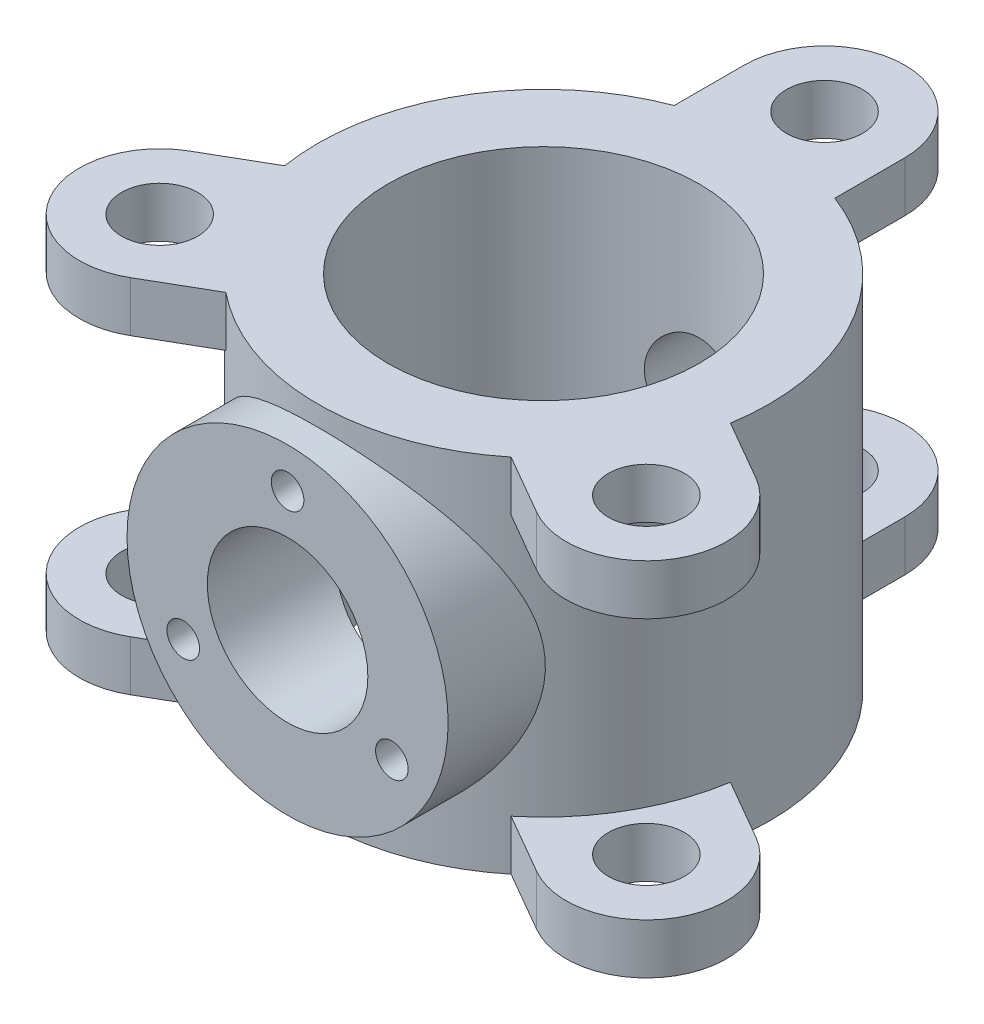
ISO-10303-21;
HEADER;
FILE_DESCRIPTION(('STEP AP214'),'2;1');
FILE_NAME('part.step','',(''),(''),'','','');
FILE_SCHEMA(('AUTOMOTIVE_DESIGN { 1 0 10303 214 1 1 1 1 }'));
ENDSEC;
DATA;
#1=APPLICATION_CONTEXT('core data for automotive mechanical design processes');
#2=APPLICATION_PROTOCOL_DEFINITION('international standard','automotive_design',2000,#1);
#3=PRODUCT_CONTEXT('',#1,'mechanical');
#4=PRODUCT('Part','Part','',(#3));
#5=PRODUCT_RELATED_PRODUCT_CATEGORY('part','',(#4));
#6=PRODUCT_DEFINITION_FORMATION('','',#4);
#7=PRODUCT_DEFINITION_CONTEXT('part definition',#1,'design');
#8=PRODUCT_DEFINITION('design','',#6,#7);
#9=PRODUCT_DEFINITION_SHAPE('','',#8);
#10=(LENGTH_UNIT() NAMED_UNIT(*) SI_UNIT(.MILLI.,.METRE.));
#11=(NAMED_UNIT(*) PLANE_ANGLE_UNIT() SI_UNIT($,.RADIAN.));
#12=(NAMED_UNIT(*) SI_UNIT($,.STERADIAN.) SOLID_ANGLE_UNIT());
#13=UNCERTAINTY_MEASURE_WITH_UNIT(LENGTH_MEASURE(1.E-05),#10,'distance_accuracy_value','');
#14=(GEOMETRIC_REPRESENTATION_CONTEXT(3) GLOBAL_UNCERTAINTY_ASSIGNED_CONTEXT((#13)) GLOBAL_UNIT_ASSIGNED_CONTEXT((#10,
#11,#12)) REPRESENTATION_CONTEXT('',''));
#15=CARTESIAN_POINT('',(0.,0.,0.));
#16=DIRECTION('',(0.,0.,1.));
#17=DIRECTION('',(1.,0.,0.));
#18=AXIS2_PLACEMENT_3D('',#15,#16,#17);
#19=CARTESIAN_POINT('',(0.,28.575,0.));
#20=DIRECTION('',(0.,-1.,0.));
#21=DIRECTION('',(0.,0.,-1.));
#22=AXIS2_PLACEMENT_3D('',#19,#20,#21);
#23=CYLINDRICAL_SURFACE('',#22,35.7124);
#24=CARTESIAN_POINT('',(-25.4,0.,25.1040935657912));
#25=CARTESIAN_POINT('',(-25.4000000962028,-0.606082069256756,25.104093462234));
#26=CARTESIAN_POINT('',(-25.3782588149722,-1.21216359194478,25.1261482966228));
#27=CARTESIAN_POINT('',(-25.2918604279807,-2.41812784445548,25.213111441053));
#28=CARTESIAN_POINT('',(-25.2272011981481,-3.01801026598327,25.278021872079));
#29=CARTESIAN_POINT('',(-25.0563343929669,-4.20736519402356,25.4473968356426));
#30=CARTESIAN_POINT('',(-24.9500397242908,-4.79681315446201,25.5519442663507));
#31=CARTESIAN_POINT('',(-24.6980632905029,-5.95985301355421,25.7955768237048));
#32=CARTESIAN_POINT('',(-24.5523790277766,-6.53344390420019,25.9346641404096));
#33=CARTESIAN_POINT('',(-24.2259254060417,-7.65518051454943,26.2398419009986));
#34=CARTESIAN_POINT('',(-24.0455928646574,-8.20354739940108,26.4055923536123));
#35=CARTESIAN_POINT('',(-23.6509087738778,-9.28026601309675,26.7596762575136));
#36=CARTESIAN_POINT('',(-23.4365581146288,-9.80861826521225,26.9480091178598));
#37=CARTESIAN_POINT('',(-22.9757262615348,-10.8442231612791,27.3419707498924));
#38=CARTESIAN_POINT('',(-22.729251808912,-11.3514802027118,27.5475958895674));
#39=CARTESIAN_POINT('',(-22.2056285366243,-12.3444377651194,27.9713971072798));
#40=CARTESIAN_POINT('',(-21.9284774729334,-12.8301367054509,28.1895741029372));
#41=CARTESIAN_POINT('',(-21.2914445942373,-13.8660927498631,28.674692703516));
#42=CARTESIAN_POINT('',(-20.9256914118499,-14.411978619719,28.9432736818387));
#43=CARTESIAN_POINT('',(-20.1544170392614,-15.4722093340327,29.4855440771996));
#44=CARTESIAN_POINT('',(-19.7488928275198,-15.986551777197,29.7592338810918));
#45=CARTESIAN_POINT('',(-18.8986470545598,-16.9832474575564,30.3063112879));
#46=CARTESIAN_POINT('',(-18.4538774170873,-17.4655601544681,30.5796980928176));
#47=CARTESIAN_POINT('',(-17.526501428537,-18.3960117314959,31.120499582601));
#48=CARTESIAN_POINT('',(-17.0438923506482,-18.844148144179,31.3879138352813));
#49=CARTESIAN_POINT('',(-15.95412049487,-19.779477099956,31.9575114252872));
#50=CARTESIAN_POINT('',(-15.3399304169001,-20.2598076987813,32.2576034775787));
#51=CARTESIAN_POINT('',(-14.0624996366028,-21.1664775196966,32.8346323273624));
#52=CARTESIAN_POINT('',(-13.3992495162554,-21.5928063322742,33.1115646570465));
#53=CARTESIAN_POINT('',(-12.0275948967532,-22.385774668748,33.6340542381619));
#54=CARTESIAN_POINT('',(-11.319268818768,-22.7525141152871,33.8796638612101));
#55=CARTESIAN_POINT('',(-10.2260272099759,-23.2540151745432,34.2191424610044));
#56=CARTESIAN_POINT('',(-9.85653176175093,-23.4130654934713,34.3274686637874));
#57=CARTESIAN_POINT('',(-9.10776583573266,-23.7143725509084,34.5336776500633));
#58=CARTESIAN_POINT('',(-8.72849298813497,-23.8566251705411,34.6315578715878));
#59=CARTESIAN_POINT('',(-7.78967366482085,-24.1831813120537,34.8571690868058));
#60=CARTESIAN_POINT('',(-7.22525251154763,-24.3578981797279,34.9787130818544));
#61=CARTESIAN_POINT('',(-6.08103322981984,-24.6684494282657,35.1956755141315));
#62=CARTESIAN_POINT('',(-5.50123847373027,-24.8042922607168,35.2910996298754));
#63=CARTESIAN_POINT('',(-4.33006653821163,-25.0353048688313,35.4538471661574));
#64=CARTESIAN_POINT('',(-3.73869694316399,-25.1305004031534,35.5211883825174));
#65=CARTESIAN_POINT('',(-2.54808269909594,-25.2789868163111,35.6263938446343));
#66=CARTESIAN_POINT('',(-1.94883777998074,-25.3322762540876,35.6642570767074));
#67=CARTESIAN_POINT('',(-0.745660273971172,-25.396213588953,35.7096999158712));
#68=CARTESIAN_POINT('',(-0.141720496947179,-25.4067719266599,35.717215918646));
#69=CARTESIAN_POINT('',(1.06497388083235,-25.3848376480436,35.701616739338));
#70=CARTESIAN_POINT('',(1.6677284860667,-25.3523451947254,35.6785016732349));
#71=CARTESIAN_POINT('',(2.86762334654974,-25.2447948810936,35.6021593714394));
#72=CARTESIAN_POINT('',(3.46476230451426,-25.16972741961,35.5489253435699));
#73=CARTESIAN_POINT('',(4.64899256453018,-24.9781237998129,35.4135227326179));
#74=CARTESIAN_POINT('',(5.23608387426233,-24.8615876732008,35.331354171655));
#75=CARTESIAN_POINT('',(6.38159640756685,-24.5921253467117,35.1422705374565));
#76=CARTESIAN_POINT('',(6.94036705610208,-24.4401996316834,35.0360377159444));
#77=CARTESIAN_POINT('',(8.04162145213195,-24.100299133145,34.7997845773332));
#78=CARTESIAN_POINT('',(8.58410558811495,-23.9123252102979,34.6697648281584));
#79=CARTESIAN_POINT('',(9.65029656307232,-23.5022988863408,34.3882443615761));
#80=CARTESIAN_POINT('',(10.1740020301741,-23.2802440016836,34.2367420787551));
#81=CARTESIAN_POINT('',(11.2005863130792,-22.8041022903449,33.9147731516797));
#82=CARTESIAN_POINT('',(11.7034638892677,-22.5500135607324,33.7443053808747));
#83=CARTESIAN_POINT('',(12.7417278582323,-21.9817337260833,33.3670800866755));
#84=CARTESIAN_POINT('',(13.2744751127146,-21.663999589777,33.1583958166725));
#85=CARTESIAN_POINT('',(14.3106644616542,-20.9939431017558,32.7245468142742));
#86=CARTESIAN_POINT('',(14.8141047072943,-20.6416185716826,32.4993810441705));
#87=CARTESIAN_POINT('',(15.7909330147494,-19.9043018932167,32.036141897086));
#88=CARTESIAN_POINT('',(16.2642942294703,-19.5192812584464,31.7980573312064));
#89=CARTESIAN_POINT('',(17.1796039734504,-18.7187321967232,31.3130171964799));
#90=CARTESIAN_POINT('',(17.6215509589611,-18.303202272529,31.0660611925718));
#91=CARTESIAN_POINT('',(18.5514002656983,-17.3642888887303,30.5215008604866));
#92=CARTESIAN_POINT('',(19.0328770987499,-16.8350972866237,30.2229102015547));
#93=CARTESIAN_POINT('',(19.9496569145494,-15.7379290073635,29.6257664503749));
#94=CARTESIAN_POINT('',(20.3849506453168,-15.1699445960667,29.327213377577));
#95=CARTESIAN_POINT('',(21.2077881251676,-13.996544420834,28.7378030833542));
#96=CARTESIAN_POINT('',(21.5953303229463,-13.3911274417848,28.4469461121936));
#97=CARTESIAN_POINT('',(22.3205058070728,-12.1439334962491,27.8815670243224));
#98=CARTESIAN_POINT('',(22.6581528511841,-11.5021666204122,27.6070404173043));
#99=CARTESIAN_POINT('',(23.2100737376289,-10.3329695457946,27.1434505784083));
#100=CARTESIAN_POINT('',(23.4349603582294,-9.81262089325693,26.9491258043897));
#101=CARTESIAN_POINT('',(23.8514887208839,-8.75163868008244,26.5811813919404));
#102=CARTESIAN_POINT('',(24.043133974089,-8.21100726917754,26.4075595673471));
#103=CARTESIAN_POINT('',(24.3908856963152,-7.11171244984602,26.0867048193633));
#104=CARTESIAN_POINT('',(24.5470471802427,-6.55307851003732,25.9394311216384));
#105=CARTESIAN_POINT('',(24.821991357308,-5.4193077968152,25.6764587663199));
#106=CARTESIAN_POINT('',(24.9407744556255,-4.84417120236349,25.5607597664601));
#107=CARTESIAN_POINT('',(25.1399404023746,-3.67416450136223,25.3649121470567));
#108=CARTESIAN_POINT('',(25.2198623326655,-3.07914295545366,25.2851910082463));
#109=CARTESIAN_POINT('',(25.3374213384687,-1.88080339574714,25.1673919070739));
#110=CARTESIAN_POINT('',(25.3750604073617,-1.27748577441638,25.1293119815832));
#111=CARTESIAN_POINT('',(25.4070961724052,-0.0688326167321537,25.0969224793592));
#112=CARTESIAN_POINT('',(25.4015155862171,0.536501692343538,25.1025899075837));
#113=CARTESIAN_POINT('',(25.3473056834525,1.74322191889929,25.1573264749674));
#114=CARTESIAN_POINT('',(25.2986788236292,2.34460805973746,25.2063931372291));
#115=CARTESIAN_POINT('',(25.1703604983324,3.44543388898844,25.3344658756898));
#116=CARTESIAN_POINT('',(25.0966274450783,3.94627235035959,25.4076768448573));
#117=CARTESIAN_POINT('',(24.9203981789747,4.93838564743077,25.5805492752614));
#118=CARTESIAN_POINT('',(24.8178917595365,5.42965702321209,25.6802201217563));
#119=CARTESIAN_POINT('',(24.585406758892,6.40056257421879,25.90287934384));
#120=CARTESIAN_POINT('',(24.455409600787,6.88018863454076,26.0258834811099));
#121=CARTESIAN_POINT('',(24.1693391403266,7.82606207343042,26.2917604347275));
#122=CARTESIAN_POINT('',(24.0132595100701,8.29230617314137,26.4346380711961));
#123=CARTESIAN_POINT('',(23.7202690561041,9.09062965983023,26.6974218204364));
#124=CARTESIAN_POINT('',(23.5889589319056,9.42601501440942,26.8136141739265));
#125=CARTESIAN_POINT('',(23.3133181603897,10.0885027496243,27.053615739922));
#126=CARTESIAN_POINT('',(23.1689899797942,10.4156066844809,27.177423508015));
#127=CARTESIAN_POINT('',(22.7169448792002,11.384580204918,27.5585034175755));
#128=CARTESIAN_POINT('',(22.3902308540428,12.0139395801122,27.8253743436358));
#129=CARTESIAN_POINT('',(21.6885356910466,13.2388294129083,28.3757323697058));
#130=CARTESIAN_POINT('',(21.3134753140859,13.8343019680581,28.6592463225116));
#131=CARTESIAN_POINT('',(20.5174956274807,14.9894706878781,29.2343796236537));
#132=CARTESIAN_POINT('',(20.0965817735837,15.5491710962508,29.5259980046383));
#133=CARTESIAN_POINT('',(19.2006203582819,16.6435321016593,30.116537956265));
#134=CARTESIAN_POINT('',(18.7245901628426,17.1773773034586,30.4154797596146));
#135=CARTESIAN_POINT('',(17.7273180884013,18.2047987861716,31.0073208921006));
#136=CARTESIAN_POINT('',(17.2060729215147,18.6983721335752,31.3002197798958));
#137=CARTESIAN_POINT('',(16.1202912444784,19.6421215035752,31.8729984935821));
#138=CARTESIAN_POINT('',(15.5558092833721,20.0923506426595,32.1528940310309));
#139=CARTESIAN_POINT('',(14.3845414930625,20.946842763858,32.6936745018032));
#140=CARTESIAN_POINT('',(13.7777630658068,21.3511137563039,32.9545627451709));
#141=CARTESIAN_POINT('',(12.6187411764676,22.0525358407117,33.4136295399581));
#142=CARTESIAN_POINT('',(12.0720965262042,22.3566444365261,33.6153289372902));
#143=CARTESIAN_POINT('',(10.9517105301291,22.9262917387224,33.9968472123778));
#144=CARTESIAN_POINT('',(10.3779715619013,23.1918338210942,34.1766680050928));
#145=CARTESIAN_POINT('',(9.20610068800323,23.6814433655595,34.5107847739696));
#146=CARTESIAN_POINT('',(8.60797826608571,23.9055267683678,34.6650905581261));
#147=CARTESIAN_POINT('',(7.39038930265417,24.3095355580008,34.9449251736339));
#148=CARTESIAN_POINT('',(6.77092262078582,24.4894606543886,35.0704538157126));
#149=CARTESIAN_POINT('',(5.51073770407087,24.8035493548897,35.2904933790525));
#150=CARTESIAN_POINT('',(4.86990942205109,24.9374148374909,35.3848020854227));
#151=CARTESIAN_POINT('',(3.57573886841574,25.1556088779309,35.5389110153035));
#152=CARTESIAN_POINT('',(2.92239653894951,25.2399372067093,35.598711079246));
#153=CARTESIAN_POINT('',(1.60908610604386,25.3575495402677,35.6821960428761));
#154=CARTESIAN_POINT('',(0.949120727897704,25.3908537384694,35.7058952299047));
#155=CARTESIAN_POINT('',(-0.371662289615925,25.4058640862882,35.7165704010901));
#156=CARTESIAN_POINT('',(-1.03247984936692,25.3875747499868,35.7035495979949));
#157=CARTESIAN_POINT('',(-2.27957101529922,25.3043881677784,35.6444506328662));
#158=CARTESIAN_POINT('',(-2.86636816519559,25.2446005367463,35.6019970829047));
#159=CARTESIAN_POINT('',(-4.03167105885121,25.0848844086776,35.4889243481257));
#160=CARTESIAN_POINT('',(-4.61017748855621,24.9849592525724,35.4183075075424));
#161=CARTESIAN_POINT('',(-5.75520764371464,24.7463064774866,35.2503619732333));
#162=CARTESIAN_POINT('',(-6.32173010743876,24.607574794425,35.1530304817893));
#163=CARTESIAN_POINT('',(-7.4394560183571,24.2930362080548,34.9335717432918));
#164=CARTESIAN_POINT('',(-7.9906587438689,24.1172275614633,34.8114433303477));
#165=CARTESIAN_POINT('',(-9.08899686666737,23.7254896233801,34.5411891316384));
#166=CARTESIAN_POINT('',(-9.63565730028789,23.5086392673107,34.3924720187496));
#167=CARTESIAN_POINT('',(-10.7074959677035,23.040218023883,34.0740027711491));
#168=CARTESIAN_POINT('',(-11.2326740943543,22.7886469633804,33.9042505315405));
#169=CARTESIAN_POINT('',(-12.2596889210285,22.2529879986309,33.5465532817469));
#170=CARTESIAN_POINT('',(-12.7615254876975,21.9688999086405,33.3586081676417));
#171=CARTESIAN_POINT('',(-13.7404923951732,21.3702630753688,32.9674432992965));
#172=CARTESIAN_POINT('',(-14.2176196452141,21.0557105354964,32.7642216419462));
#173=CARTESIAN_POINT('',(-15.2179137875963,20.3471531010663,32.3130986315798));
#174=CARTESIAN_POINT('',(-15.736786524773,19.9483844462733,32.0631484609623));
#175=CARTESIAN_POINT('',(-16.7389421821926,19.115243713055,31.5515440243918));
#176=CARTESIAN_POINT('',(-17.2222219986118,18.6808685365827,31.2898887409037));
#177=CARTESIAN_POINT('',(-18.1530761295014,17.7777145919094,30.7592074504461));
#178=CARTESIAN_POINT('',(-18.6005845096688,17.3088752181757,30.4901690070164));
#179=CARTESIAN_POINT('',(-19.4580451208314,16.3390178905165,29.9502377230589));
#180=CARTESIAN_POINT('',(-19.8679952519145,15.8379981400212,29.6793447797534));
#181=CARTESIAN_POINT('',(-20.7155301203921,14.717353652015,29.0955301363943));
#182=CARTESIAN_POINT('',(-21.1460387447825,14.0920116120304,28.7832594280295));
#183=CARTESIAN_POINT('',(-21.9522625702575,12.7999281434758,28.1732018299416));
#184=CARTESIAN_POINT('',(-22.3279633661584,12.1331758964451,27.8754187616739));
#185=CARTESIAN_POINT('',(-23.0208274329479,10.7606480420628,27.3060022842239));
#186=CARTESIAN_POINT('',(-23.3380835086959,10.054936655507,27.0343277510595));
#187=CARTESIAN_POINT('',(-23.91045162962,8.60560803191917,26.5294471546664));
#188=CARTESIAN_POINT('',(-24.16559726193,7.86201154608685,26.2962203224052));
#189=CARTESIAN_POINT('',(-24.551497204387,6.53681660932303,25.9355017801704));
#190=CARTESIAN_POINT('',(-24.6973647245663,5.9628026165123,25.7962472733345));
#191=CARTESIAN_POINT('',(-24.9496425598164,4.79891972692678,25.5523332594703));
#192=CARTESIAN_POINT('',(-25.056060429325,4.20905388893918,25.4476671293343));
#193=CARTESIAN_POINT('',(-25.2270790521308,3.01907771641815,25.2781442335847));
#194=CARTESIAN_POINT('',(-25.2917825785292,2.41899632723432,25.2131896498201));
#195=CARTESIAN_POINT('',(-25.3782424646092,1.21260967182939,25.126164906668));
#196=CARTESIAN_POINT('',(-25.3999999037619,0.606304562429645,25.1040936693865));
#197=CARTESIAN_POINT('',(-25.4,0.,25.1040935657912));
#198=B_SPLINE_CURVE_WITH_KNOTS('',3,(#24,#25,#26,#27,#28,#29,#30,#31,#32,#33,#34,#35,#36,#37,
#38,#39,#40,#41,#42,#43,#44,#45,#46,#47,#48,#49,#50,#51,#52,#53,#54,#55,#56,#57,#58,#59,#60,#61,
#62,#63,#64,#65,#66,#67,#68,#69,#70,#71,#72,#73,#74,#75,#76,#77,#78,#79,#80,#81,#82,#83,#84,#85,
#86,#87,#88,#89,#90,#91,#92,#93,#94,#95,#96,#97,#98,#99,#100,#101,#102,#103,#104,#105,#106,#107,
#108,#109,#110,#111,#112,#113,#114,#115,#116,#117,#118,#119,#120,#121,#122,#123,#124,#125,#126,
#127,#128,#129,#130,#131,#132,#133,#134,#135,#136,#137,#138,#139,#140,#141,#142,#143,#144,#145,
#146,#147,#148,#149,#150,#151,#152,#153,#154,#155,#156,#157,#158,#159,#160,#161,#162,#163,#164,
#165,#166,#167,#168,#169,#170,#171,#172,#173,#174,#175,#176,#177,#178,#179,#180,#181,#182,#183,
#184,#185,#186,#187,#188,#189,#190,#191,#192,#193,#194,#195,#196,#197),.UNSPECIFIED.,.T.,.F.,(4,
2,2,2,2,2,2,2,2,2,2,2,2,2,2,2,2,2,2,2,2,2,2,2,2,2,2,2,2,2,2,2,2,2,2,2,2,2,2,2,2,2,2,2,2,2,2,2,2,
2,2,2,2,2,2,2,2,2,2,2,2,2,2,2,2,2,2,2,2,2,2,2,2,2,2,2,2,2,2,2,2,2,2,2,2,2,4),(0.,
1.81747401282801,3.63503798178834,5.45642442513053,7.27792638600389,9.07781510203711,
10.8776567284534,12.6771212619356,14.4767175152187,16.6043611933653,18.7321666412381,
20.8626158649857,22.9932187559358,25.496180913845,27.9996248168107,30.4988264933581,
31.7481427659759,32.9977647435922,34.8053808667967,36.6126036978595,38.4186795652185,
40.2248175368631,42.0347390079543,43.844653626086,45.654976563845,47.4652981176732,
49.2295950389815,50.9938498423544,52.7582332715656,54.5227215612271,56.4842153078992,
58.4458326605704,60.4091769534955,62.3726176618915,64.6959599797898,67.0197668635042,
69.3436492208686,71.6668896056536,73.4631961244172,75.2593127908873,77.0526254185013,
78.8459186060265,80.659991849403,82.4739795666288,84.2870138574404,86.0999446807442,
87.6328486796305,89.1662971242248,90.700785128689,92.235645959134,93.3706120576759,
94.5053635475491,96.7754409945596,99.0492875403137,101.322863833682,103.646166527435,
105.969638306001,108.29022552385,110.610407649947,112.580270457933,114.549960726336,
116.518892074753,118.487836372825,120.46929498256,122.450762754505,124.431446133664,
126.411956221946,128.183957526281,129.955811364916,131.727850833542,133.499973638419,
135.317987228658,137.13600988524,138.954042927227,140.77230283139,142.871808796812,
144.971497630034,147.074971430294,149.178562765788,151.638376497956,154.098835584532,
156.555353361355,159.010539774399,160.833583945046,162.656278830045,164.474465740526,
166.2926069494),.UNSPECIFIED.);
#199=CARTESIAN_POINT('',(-25.4,0.,25.1040935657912));
#200=VERTEX_POINT('',#199);
#201=EDGE_CURVE('E45',#200,#200,#198,.T.);
#202=ORIENTED_EDGE('',*,*,#201,.F.);
#203=EDGE_LOOP('',(#202));
#204=FACE_BOUND('',#203,.T.);
#205=CARTESIAN_POINT('',(0.,-20.6248,0.));
#206=DIRECTION('',(0.,-1.,0.));
#207=DIRECTION('',(0.866025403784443,0.,-0.499999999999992));
#208=AXIS2_PLACEMENT_3D('',#205,#206,#207);
#209=CIRCLE('',#208,35.7124);
#210=CARTESIAN_POINT('',(-22.5561262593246,-20.6248,27.6874824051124));
#211=VERTEX_POINT('',#210);
#212=CARTESIAN_POINT('',(-35.2561262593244,-20.6248,5.69043714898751));
#213=VERTEX_POINT('',#212);
#214=EDGE_CURVE('E234',#211,#213,#209,.T.);
#215=ORIENTED_EDGE('',*,*,#214,.F.);
#216=DIRECTION('',(0.,-1.,0.));
#217=VECTOR('',#216,1.);
#218=CARTESIAN_POINT('',(-22.5561262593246,-20.6248,27.6874824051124));
#219=LINE('',#218,#217);
#220=CARTESIAN_POINT('',(-22.5561262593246,-28.575,27.6874824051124));
#221=VERTEX_POINT('',#220);
#222=EDGE_CURVE('E209',#211,#221,#219,.T.);
#223=ORIENTED_EDGE('',*,*,#222,.T.);
#224=CARTESIAN_POINT('',(0.,-28.575,0.));
#225=DIRECTION('',(0.,1.,0.));
#226=DIRECTION('',(0.,0.,1.));
#227=AXIS2_PLACEMENT_3D('',#224,#225,#226);
#228=CIRCLE('',#227,35.7124);
#229=CARTESIAN_POINT('',(22.5561262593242,-28.575,27.6874824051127));
#230=VERTEX_POINT('',#229);
#231=EDGE_CURVE('E224',#221,#230,#228,.T.);
#232=ORIENTED_EDGE('',*,*,#231,.T.);
#233=DIRECTION('',(0.,-1.,0.));
#234=VECTOR('',#233,1.);
#235=CARTESIAN_POINT('',(22.5561262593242,-20.6248,27.6874824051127));
#236=LINE('',#235,#234);
#237=CARTESIAN_POINT('',(22.5561262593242,-20.6248,27.6874824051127));
#238=VERTEX_POINT('',#237);
#239=EDGE_CURVE('E265',#238,#230,#236,.T.);
#240=ORIENTED_EDGE('',*,*,#239,.F.);
#241=CARTESIAN_POINT('',(0.,-20.6248,0.));
#242=DIRECTION('',(0.,-1.,0.));
#243=DIRECTION('',(-0.866025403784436,0.,-0.500000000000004));
#244=AXIS2_PLACEMENT_3D('',#241,#242,#243);
#245=CIRCLE('',#244,35.7124);
#246=CARTESIAN_POINT('',(35.2561262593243,-20.6248,5.69043714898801));
#247=VERTEX_POINT('',#246);
#248=EDGE_CURVE('E256',#247,#238,#245,.T.);
#249=ORIENTED_EDGE('',*,*,#248,.F.);
#250=DIRECTION('',(0.,-1.,0.));
#251=VECTOR('',#250,1.);
#252=CARTESIAN_POINT('',(35.2561262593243,-20.6248,5.69043714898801));
#253=LINE('',#252,#251);
#254=CARTESIAN_POINT('',(35.2561262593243,-28.575,5.69043714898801));
#255=VERTEX_POINT('',#254);
#256=EDGE_CURVE('E268',#247,#255,#253,.T.);
#257=ORIENTED_EDGE('',*,*,#256,.T.);
#258=CARTESIAN_POINT('',(12.7,-28.575,-33.3779195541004));
#259=VERTEX_POINT('',#258);
#260=EDGE_CURVE('E292',#255,#259,#228,.T.);
#261=ORIENTED_EDGE('',*,*,#260,.T.);
#262=DIRECTION('',(0.,-1.,0.));
#263=VECTOR('',#262,1.);
#264=CARTESIAN_POINT('',(12.7,-20.6248,-33.3779195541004));
#265=LINE('',#264,#263);
#266=CARTESIAN_POINT('',(12.7,-20.6248,-33.3779195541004));
#267=VERTEX_POINT('',#266);
#268=EDGE_CURVE('E293',#267,#259,#265,.T.);
#269=ORIENTED_EDGE('',*,*,#268,.F.);
#270=CARTESIAN_POINT('',(0.,-20.6248,0.));
#271=DIRECTION('',(0.,-1.,0.));
#272=DIRECTION('',(0.,0.,1.));
#273=AXIS2_PLACEMENT_3D('',#270,#271,#272);
#274=CIRCLE('',#273,35.7124);
#275=CARTESIAN_POINT('',(-12.7,-20.6248,-33.3779195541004));
#276=VERTEX_POINT('',#275);
#277=EDGE_CURVE('E284',#276,#267,#274,.T.);
#278=ORIENTED_EDGE('',*,*,#277,.F.);
#279=DIRECTION('',(0.,-1.,0.));
#280=VECTOR('',#279,1.);
#281=CARTESIAN_POINT('',(-12.7,-20.6248,-33.3779195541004));
#282=LINE('',#281,#280);
#283=CARTESIAN_POINT('',(-12.7,-28.575,-33.3779195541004));
#284=VERTEX_POINT('',#283);
#285=EDGE_CURVE('E296',#276,#284,#282,.T.);
#286=ORIENTED_EDGE('',*,*,#285,.T.);
#287=CARTESIAN_POINT('',(-35.2561262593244,-28.575,5.69043714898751));
#288=VERTEX_POINT('',#287);
#289=EDGE_CURVE('E300',#284,#288,#228,.T.);
#290=ORIENTED_EDGE('',*,*,#289,.T.);
#291=DIRECTION('',(0.,-1.,0.));
#292=VECTOR('',#291,1.);
#293=CARTESIAN_POINT('',(-35.2561262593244,-20.6248,5.69043714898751));
#294=LINE('',#293,#292);
#295=EDGE_CURVE('E240',#213,#288,#294,.T.);
#296=ORIENTED_EDGE('',*,*,#295,.F.);
#297=EDGE_LOOP('',(#215,#223,#232,#240,#249,#257,#261,#269,#278,#286,#290,#296));
#298=FACE_BOUND('',#297,.T.);
#299=CARTESIAN_POINT('',(0.,20.6248,0.));
#300=DIRECTION('',(0.,-1.,0.));
#301=DIRECTION('',(0.866025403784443,0.,-0.499999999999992));
#302=AXIS2_PLACEMENT_3D('',#299,#300,#301);
#303=CIRCLE('',#302,35.7124);
#304=CARTESIAN_POINT('',(-22.5561262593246,20.6248,27.6874824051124));
#305=VERTEX_POINT('',#304);
#306=CARTESIAN_POINT('',(-35.2561262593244,20.6248,5.69043714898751));
#307=VERTEX_POINT('',#306);
#308=EDGE_CURVE('E338',#305,#307,#303,.T.);
#309=ORIENTED_EDGE('',*,*,#308,.T.);
#310=DIRECTION('',(0.,1.,0.));
#311=VECTOR('',#310,1.);
#312=CARTESIAN_POINT('',(-35.2561262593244,20.6248,5.69043714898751));
#313=LINE('',#312,#311);
#314=CARTESIAN_POINT('',(-35.2561262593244,28.575,5.69043714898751));
#315=VERTEX_POINT('',#314);
#316=EDGE_CURVE('E348',#307,#315,#313,.T.);
#317=ORIENTED_EDGE('',*,*,#316,.T.);
#318=CARTESIAN_POINT('',(0.,28.575,0.));
#319=DIRECTION('',(0.,1.,0.));
#320=DIRECTION('',(0.,0.,1.));
#321=AXIS2_PLACEMENT_3D('',#318,#319,#320);
#322=CIRCLE('',#321,35.7124);
#323=CARTESIAN_POINT('',(-12.7,28.575,-33.3779195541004));
#324=VERTEX_POINT('',#323);
#325=EDGE_CURVE('E411',#324,#315,#322,.T.);
#326=ORIENTED_EDGE('',*,*,#325,.F.);
#327=DIRECTION('',(0.,1.,0.));
#328=VECTOR('',#327,1.);
#329=CARTESIAN_POINT('',(-12.7,20.6248,-33.3779195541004));
#330=LINE('',#329,#328);
#331=CARTESIAN_POINT('',(-12.7,20.6248,-33.3779195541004));
#332=VERTEX_POINT('',#331);
#333=EDGE_CURVE('E407',#332,#324,#330,.T.);
#334=ORIENTED_EDGE('',*,*,#333,.F.);
#335=CARTESIAN_POINT('',(0.,20.6248,0.));
#336=DIRECTION('',(0.,-1.,0.));
#337=DIRECTION('',(0.,0.,1.));
#338=AXIS2_PLACEMENT_3D('',#335,#336,#337);
#339=CIRCLE('',#338,35.7124);
#340=CARTESIAN_POINT('',(12.7,20.6248,-33.3779195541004));
#341=VERTEX_POINT('',#340);
#342=EDGE_CURVE('E394',#332,#341,#339,.T.);
#343=ORIENTED_EDGE('',*,*,#342,.T.);
#344=DIRECTION('',(0.,1.,0.));
#345=VECTOR('',#344,1.);
#346=CARTESIAN_POINT('',(12.7,20.6248,-33.3779195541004));
#347=LINE('',#346,#345);
#348=CARTESIAN_POINT('',(12.7,28.575,-33.3779195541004));
#349=VERTEX_POINT('',#348);
#350=EDGE_CURVE('E404',#341,#349,#347,.T.);
#351=ORIENTED_EDGE('',*,*,#350,.T.);
#352=CARTESIAN_POINT('',(35.2561262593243,28.575,5.69043714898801));
#353=VERTEX_POINT('',#352);
#354=EDGE_CURVE('E403',#353,#349,#322,.T.);
#355=ORIENTED_EDGE('',*,*,#354,.F.);
#356=DIRECTION('',(0.,1.,0.));
#357=VECTOR('',#356,1.);
#358=CARTESIAN_POINT('',(35.2561262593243,20.6248,5.69043714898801));
#359=LINE('',#358,#357);
#360=CARTESIAN_POINT('',(35.2561262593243,20.6248,5.69043714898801));
#361=VERTEX_POINT('',#360);
#362=EDGE_CURVE('E378',#361,#353,#359,.T.);
#363=ORIENTED_EDGE('',*,*,#362,.F.);
#364=CARTESIAN_POINT('',(0.,20.6248,0.));
#365=DIRECTION('',(0.,-1.,0.));
#366=DIRECTION('',(-0.866025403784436,0.,-0.500000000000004));
#367=AXIS2_PLACEMENT_3D('',#364,#365,#366);
#368=CIRCLE('',#367,35.7124);
#369=CARTESIAN_POINT('',(22.5561262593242,20.6248,27.6874824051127));
#370=VERTEX_POINT('',#369);
#371=EDGE_CURVE('E365',#361,#370,#368,.T.);
#372=ORIENTED_EDGE('',*,*,#371,.T.);
#373=DIRECTION('',(0.,1.,0.));
#374=VECTOR('',#373,1.);
#375=CARTESIAN_POINT('',(22.5561262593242,20.6248,27.6874824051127));
#376=LINE('',#375,#374);
#377=CARTESIAN_POINT('',(22.5561262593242,28.575,27.6874824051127));
#378=VERTEX_POINT('',#377);
#379=EDGE_CURVE('E375',#370,#378,#376,.T.);
#380=ORIENTED_EDGE('',*,*,#379,.T.);
#381=CARTESIAN_POINT('',(-22.5561262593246,28.575,27.6874824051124));
#382=VERTEX_POINT('',#381);
#383=EDGE_CURVE('E414',#382,#378,#322,.T.);
#384=ORIENTED_EDGE('',*,*,#383,.F.);
#385=DIRECTION('',(0.,1.,0.));
#386=VECTOR('',#385,1.);
#387=CARTESIAN_POINT('',(-22.5561262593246,20.6248,27.6874824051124));
#388=LINE('',#387,#386);
#389=EDGE_CURVE('E351',#305,#382,#388,.T.);
#390=ORIENTED_EDGE('',*,*,#389,.F.);
#391=EDGE_LOOP('',(#309,#317,#326,#334,#343,#351,#355,#363,#372,#380,#384,#390));
#392=FACE_BOUND('',#391,.T.);
#393=CARTESIAN_POINT('',(0.,9.0875,-35.7124));
#394=CARTESIAN_POINT('',(0.250978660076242,9.08750777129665,-35.7124047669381));
#395=CARTESIAN_POINT('',(0.501873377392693,9.0771012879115,-35.7097504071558));
#396=CARTESIAN_POINT('',(1.0019038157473,9.0355815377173,-35.6992175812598));
#397=CARTESIAN_POINT('',(1.25103934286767,9.00446602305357,-35.691338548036));
#398=CARTESIAN_POINT('',(1.74573802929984,8.92177034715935,-35.6705657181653));
#399=CARTESIAN_POINT('',(1.9913001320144,8.87018425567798,-35.65767046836));
#400=CARTESIAN_POINT('',(2.47714037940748,8.74695695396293,-35.6272163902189));
#401=CARTESIAN_POINT('',(2.71741653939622,8.67530834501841,-35.6096558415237));
#402=CARTESIAN_POINT('',(3.19053881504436,8.51267259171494,-35.5703843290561));
#403=CARTESIAN_POINT('',(3.42339634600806,8.42171699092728,-35.54868014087));
#404=CARTESIAN_POINT('',(3.88061412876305,8.22106090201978,-35.5016786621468));
#405=CARTESIAN_POINT('',(4.10497116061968,8.11135339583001,-35.4763800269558));
#406=CARTESIAN_POINT('',(4.54354534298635,7.87407081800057,-35.4228810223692));
#407=CARTESIAN_POINT('',(4.75776649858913,7.74650288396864,-35.3946818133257));
#408=CARTESIAN_POINT('',(5.17489774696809,7.47429886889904,-35.3361052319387));
#409=CARTESIAN_POINT('',(5.37780260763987,7.32965498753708,-35.305726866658));
#410=CARTESIAN_POINT('',(5.77468663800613,7.0213948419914,-35.2430084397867));
#411=CARTESIAN_POINT('',(5.96842108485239,6.8574687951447,-35.2106419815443));
#412=CARTESIAN_POINT('',(6.34137979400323,6.51412151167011,-35.1453873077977));
#413=CARTESIAN_POINT('',(6.52061025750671,6.33470696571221,-35.1124993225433));
#414=CARTESIAN_POINT('',(6.86357675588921,5.96139660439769,-35.0470730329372));
#415=CARTESIAN_POINT('',(7.02730463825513,5.7674932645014,-35.0145349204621));
#416=CARTESIAN_POINT('',(7.33800713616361,5.3666184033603,-34.9507412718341));
#417=CARTESIAN_POINT('',(7.48498799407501,5.15965179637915,-34.9194852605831));
#418=CARTESIAN_POINT('',(7.76344789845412,4.73053748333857,-34.8586435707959));
#419=CARTESIAN_POINT('',(7.89464346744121,4.50820078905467,-34.8290923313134));
#420=CARTESIAN_POINT('',(8.13773922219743,4.05295160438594,-34.7730970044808));
#421=CARTESIAN_POINT('',(8.24964683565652,3.82004322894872,-34.7466517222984));
#422=CARTESIAN_POINT('',(8.45335569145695,3.34517355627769,-34.6976551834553));
#423=CARTESIAN_POINT('',(8.54515552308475,3.10321162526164,-34.6751042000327));
#424=CARTESIAN_POINT('',(8.70787545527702,2.6119915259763,-34.6345991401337));
#425=CARTESIAN_POINT('',(8.77879607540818,2.36273353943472,-34.6166449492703));
#426=CARTESIAN_POINT('',(8.89789713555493,1.86398751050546,-34.5862204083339));
#427=CARTESIAN_POINT('',(8.9465179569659,1.61461106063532,-34.5736442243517));
#428=CARTESIAN_POINT('',(9.02272639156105,1.11245376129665,-34.5538344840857));
#429=CARTESIAN_POINT('',(9.05031426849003,0.859672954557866,-34.5466008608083));
#430=CARTESIAN_POINT('',(9.08420947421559,0.352628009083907,-34.537703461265));
#431=CARTESIAN_POINT('',(9.0905199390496,0.098364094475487,-34.5360388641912));
#432=CARTESIAN_POINT('',(9.08181207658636,-0.409770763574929,-34.5383297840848));
#433=CARTESIAN_POINT('',(9.06679405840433,-0.66364171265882,-34.5422852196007));
#434=CARTESIAN_POINT('',(9.01621698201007,-1.16266004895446,-34.5555205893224));
#435=CARTESIAN_POINT('',(8.98118949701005,-1.40786519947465,-34.5646626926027));
#436=CARTESIAN_POINT('',(8.89128293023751,-1.89446039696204,-34.587898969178));
#437=CARTESIAN_POINT('',(8.83639670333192,-2.1358490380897,-34.601994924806));
#438=CARTESIAN_POINT('',(8.70723058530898,-2.61302099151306,-34.6347236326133));
#439=CARTESIAN_POINT('',(8.63295368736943,-2.84880516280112,-34.6533556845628));
#440=CARTESIAN_POINT('',(8.46557857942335,-3.31324152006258,-34.6946237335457));
#441=CARTESIAN_POINT('',(8.37247950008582,-3.54189337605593,-34.7172599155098));
#442=CARTESIAN_POINT('',(8.16709514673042,-3.99289939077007,-34.7661519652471));
#443=CARTESIAN_POINT('',(8.05462104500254,-4.21516373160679,-34.7924429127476));
#444=CARTESIAN_POINT('',(7.81197863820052,-4.64946482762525,-34.8477255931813));
#445=CARTESIAN_POINT('',(7.68180986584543,-4.86150131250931,-34.8767173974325));
#446=CARTESIAN_POINT('',(7.40465591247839,-5.27403889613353,-34.9366094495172));
#447=CARTESIAN_POINT('',(7.25766838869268,-5.47453838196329,-34.9675099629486));
#448=CARTESIAN_POINT('',(6.94785904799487,-5.86272827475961,-35.0303831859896));
#449=CARTESIAN_POINT('',(6.78503690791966,-6.05041842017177,-35.0623559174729));
#450=CARTESIAN_POINT('',(6.43954943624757,-6.41717938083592,-35.1274752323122));
#451=CARTESIAN_POINT('',(6.25643916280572,-6.59583014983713,-35.1606285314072));
#452=CARTESIAN_POINT('',(5.8757464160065,-6.93711846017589,-35.226246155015));
#453=CARTESIAN_POINT('',(5.6781639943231,-7.0997560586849,-35.2587104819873));
#454=CARTESIAN_POINT('',(5.26980919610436,-7.40791460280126,-35.3220513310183));
#455=CARTESIAN_POINT('',(5.05903590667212,-7.55343436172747,-35.3529277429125));
#456=CARTESIAN_POINT('',(4.62571648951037,-7.82629892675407,-35.4122305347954));
#457=CARTESIAN_POINT('',(4.40317080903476,-7.95364442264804,-35.4406570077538));
#458=CARTESIAN_POINT('',(3.94690850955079,-8.18967621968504,-35.4943712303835));
#459=CARTESIAN_POINT('',(3.71315157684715,-8.29828753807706,-35.5196462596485));
#460=CARTESIAN_POINT('',(3.23700560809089,-8.49534042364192,-35.5661988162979));
#461=CARTESIAN_POINT('',(2.99462002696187,-8.58378996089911,-35.5874779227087));
#462=CARTESIAN_POINT('',(2.50286367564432,-8.73984412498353,-35.6254403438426));
#463=CARTESIAN_POINT('',(2.25349262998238,-8.80744792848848,-35.6421234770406));
#464=CARTESIAN_POINT('',(1.74962574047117,-8.92122005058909,-35.6704076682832));
#465=CARTESIAN_POINT('',(1.49513002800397,-8.96738891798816,-35.6820088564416));
#466=CARTESIAN_POINT('',(0.989727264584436,-9.03694822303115,-35.6995544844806));
#467=CARTESIAN_POINT('',(0.738903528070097,-9.06090923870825,-35.7056405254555));
#468=CARTESIAN_POINT('',(0.236061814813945,-9.0879217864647,-35.7125049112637));
#469=CARTESIAN_POINT('',(-0.0159561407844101,-9.09097368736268,-35.7132833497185));
#470=CARTESIAN_POINT('',(-0.519312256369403,-9.07614255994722,-35.7095109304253));
#471=CARTESIAN_POINT('',(-0.770650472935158,-9.05826133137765,-35.7049605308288));
#472=CARTESIAN_POINT('',(-1.27082767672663,-9.00172183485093,-35.6906585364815));
#473=CARTESIAN_POINT('',(-1.51966667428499,-8.96306365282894,-35.6809069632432));
#474=CARTESIAN_POINT('',(-2.00918076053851,-8.86606633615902,-35.6566659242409));
#475=CARTESIAN_POINT('',(-2.24992266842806,-8.80804469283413,-35.6422529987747));
#476=CARTESIAN_POINT('',(-2.72567670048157,-8.67263137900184,-35.6090309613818));
#477=CARTESIAN_POINT('',(-2.96068672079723,-8.5952327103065,-35.5902202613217));
#478=CARTESIAN_POINT('',(-3.42324648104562,-8.42170067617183,-35.5487103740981));
#479=CARTESIAN_POINT('',(-3.65079839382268,-8.32557282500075,-35.526012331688));
#480=CARTESIAN_POINT('',(-4.09712226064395,-8.11524073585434,-35.4773099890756));
#481=CARTESIAN_POINT('',(-4.31589082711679,-8.00102960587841,-35.4513044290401));
#482=CARTESIAN_POINT('',(-4.74698597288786,-7.75317327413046,-35.3961820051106));
#483=CARTESIAN_POINT('',(-4.95912822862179,-7.6192179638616,-35.3670179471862));
#484=CARTESIAN_POINT('',(-5.3715246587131,-7.33431793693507,-35.3067371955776));
#485=CARTESIAN_POINT('',(-5.57177341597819,-7.18336556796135,-35.2756196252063));
#486=CARTESIAN_POINT('',(-5.9590451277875,-6.86550800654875,-35.2122678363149));
#487=CARTESIAN_POINT('',(-6.14606599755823,-6.69860030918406,-35.1800334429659));
#488=CARTESIAN_POINT('',(-6.50558676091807,-6.35001293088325,-35.1153272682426));
#489=CARTESIAN_POINT('',(-6.67809285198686,-6.16833962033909,-35.0828555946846));
#490=CARTESIAN_POINT('',(-7.01185166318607,-5.7864119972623,-35.0176971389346));
#491=CARTESIAN_POINT('',(-7.17269600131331,-5.58579776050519,-34.9850266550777));
#492=CARTESIAN_POINT('',(-7.47686230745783,-5.17157489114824,-34.9212856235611));
#493=CARTESIAN_POINT('',(-7.62019073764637,-4.95797109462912,-34.8902144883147));
#494=CARTESIAN_POINT('',(-7.88841365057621,-4.51904399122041,-34.8305517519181));
#495=CARTESIAN_POINT('',(-8.01330134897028,-4.29371641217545,-34.8019610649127));
#496=CARTESIAN_POINT('',(-8.24358860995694,-3.83303902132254,-34.748132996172));
#497=CARTESIAN_POINT('',(-8.3489960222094,-3.59769329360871,-34.7228942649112));
#498=CARTESIAN_POINT('',(-8.53899339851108,-3.11992835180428,-34.6766581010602));
#499=CARTESIAN_POINT('',(-8.62370039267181,-2.87755799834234,-34.6556369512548));
#500=CARTESIAN_POINT('',(-8.77238189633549,-2.3861807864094,-34.6183002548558));
#501=CARTESIAN_POINT('',(-8.83635643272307,-2.13717393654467,-34.6019847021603));
#502=CARTESIAN_POINT('',(-8.94300854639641,-1.63440477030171,-34.574573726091));
#503=CARTESIAN_POINT('',(-8.98569020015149,-1.38064337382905,-34.5634773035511));
#504=CARTESIAN_POINT('',(-9.04939123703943,-0.870237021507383,-34.5468539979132));
#505=CARTESIAN_POINT('',(-9.07041116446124,-0.613592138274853,-34.5413269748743));
#506=CARTESIAN_POINT('',(-9.09029768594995,-0.107058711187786,-34.5360984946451));
#507=CARTESIAN_POINT('',(-9.0898061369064,0.142803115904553,-34.5362282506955));
#508=CARTESIAN_POINT('',(-9.06826035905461,0.641573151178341,-34.5418918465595));
#509=CARTESIAN_POINT('',(-9.04720656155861,0.890481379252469,-34.5474255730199));
#510=CARTESIAN_POINT('',(-8.98471899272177,1.38554274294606,-34.5637292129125));
#511=CARTESIAN_POINT('',(-8.94328579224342,1.63169595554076,-34.5744989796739));
#512=CARTESIAN_POINT('',(-8.84038895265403,2.11950885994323,-34.6009516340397));
#513=CARTESIAN_POINT('',(-8.77892521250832,2.36116852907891,-34.6166345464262));
#514=CARTESIAN_POINT('',(-8.63694054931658,2.83673945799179,-34.6523316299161));
#515=CARTESIAN_POINT('',(-8.55654833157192,3.07069138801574,-34.6723164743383));
#516=CARTESIAN_POINT('',(-8.37708029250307,3.53103919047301,-34.7161139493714));
#517=CARTESIAN_POINT('',(-8.27799772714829,3.75743230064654,-34.7399279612));
#518=CARTESIAN_POINT('',(-8.06190549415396,4.20109694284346,-34.7907100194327));
#519=CARTESIAN_POINT('',(-7.94489739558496,4.41836927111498,-34.8176777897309));
#520=CARTESIAN_POINT('',(-7.69376068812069,4.84246213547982,-34.8740321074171));
#521=CARTESIAN_POINT('',(-7.55963124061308,5.04928215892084,-34.9034187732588));
#522=CARTESIAN_POINT('',(-7.27130977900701,5.45661415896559,-34.964637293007));
#523=CARTESIAN_POINT('',(-7.11667431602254,5.65680567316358,-34.9965137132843));
#524=CARTESIAN_POINT('',(-6.79133473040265,6.04353232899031,-35.0611007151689));
#525=CARTESIAN_POINT('',(-6.62063034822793,6.23006724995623,-35.0938113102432));
#526=CARTESIAN_POINT('',(-6.26422790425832,6.58832004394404,-35.1591778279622));
#527=CARTESIAN_POINT('',(-6.07852622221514,6.76003431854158,-35.191833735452));
#528=CARTESIAN_POINT('',(-5.69336776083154,7.08746137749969,-35.2561936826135));
#529=CARTESIAN_POINT('',(-5.49391126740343,7.24317449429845,-35.2878977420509));
#530=CARTESIAN_POINT('',(-5.07856612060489,7.54037617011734,-35.3500863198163));
#531=CARTESIAN_POINT('',(-4.86243549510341,7.68153421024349,-35.380535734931));
#532=CARTESIAN_POINT('',(-4.41875788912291,7.9450480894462,-35.4386813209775));
#533=CARTESIAN_POINT('',(-4.19121513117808,8.0674108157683,-35.4663784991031));
#534=CARTESIAN_POINT('',(-3.72628952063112,8.29241024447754,-35.5182337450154));
#535=CARTESIAN_POINT('',(-3.48891078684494,8.39505510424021,-35.5423932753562));
#536=CARTESIAN_POINT('',(-3.00600203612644,8.57983023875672,-35.5864908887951));
#537=CARTESIAN_POINT('',(-2.76047321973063,8.66196351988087,-35.6064295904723));
#538=CARTESIAN_POINT('',(-2.10476836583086,8.85051560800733,-35.6526484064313));
#539=CARTESIAN_POINT('',(-1.68906448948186,8.93922677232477,-35.6749129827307));
#540=CARTESIAN_POINT('',(-0.848826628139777,9.05771001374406,-35.704784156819));
#541=CARTESIAN_POINT('',(-0.424293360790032,9.08748686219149,-35.7123919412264));
#542=CARTESIAN_POINT('',(0.,9.0875,-35.7124));
#543=B_SPLINE_CURVE_WITH_KNOTS('',3,(#393,#394,#395,#396,#397,#398,#399,#400,#401,#402,#403,
#404,#405,#406,#407,#408,#409,#410,#411,#412,#413,#414,#415,#416,#417,#418,#419,#420,#421,#422,
#423,#424,#425,#426,#427,#428,#429,#430,#431,#432,#433,#434,#435,#436,#437,#438,#439,#440,#441,
#442,#443,#444,#445,#446,#447,#448,#449,#450,#451,#452,#453,#454,#455,#456,#457,#458,#459,#460,
#461,#462,#463,#464,#465,#466,#467,#468,#469,#470,#471,#472,#473,#474,#475,#476,#477,#478,#479,
#480,#481,#482,#483,#484,#485,#486,#487,#488,#489,#490,#491,#492,#493,#494,#495,#496,#497,#498,
#499,#500,#501,#502,#503,#504,#505,#506,#507,#508,#509,#510,#511,#512,#513,#514,#515,#516,#517,
#518,#519,#520,#521,#522,#523,#524,#525,#526,#527,#528,#529,#530,#531,#532,#533,#534,#535,#536,
#537,#538,#539,#540,#541,#542),.UNSPECIFIED.,.T.,.F.,(4,2,2,2,2,2,2,2,2,2,2,2,2,2,2,2,2,2,2,2,2,
2,2,2,2,2,2,2,2,2,2,2,2,2,2,2,2,2,2,2,2,2,2,2,2,2,2,2,2,2,2,2,2,2,2,2,2,2,2,2,2,2,2,2,2,2,2,2,2,
2,2,2,2,2,4),(0.,0.752561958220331,1.50520561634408,2.25806747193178,3.01120733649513,
3.76312607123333,4.51532683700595,5.2672278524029,6.01947367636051,6.78609733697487,
7.55239147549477,8.31908638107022,9.08549456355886,9.86408257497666,10.6423700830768,
11.4207121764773,12.199034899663,12.9612444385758,13.723444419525,14.4855320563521,
15.2476086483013,15.9903234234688,16.733305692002,17.4761733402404,18.2190753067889,
18.9696759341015,19.7202963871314,20.4710215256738,21.221761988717,21.9947421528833,
22.7677195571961,23.5407505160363,24.3137521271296,25.089779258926,25.8654990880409,
26.6412495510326,27.4169801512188,28.1721778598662,28.9273622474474,29.6824817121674,
30.437598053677,31.1808962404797,31.9244632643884,32.6678116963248,33.4114441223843,
34.1683310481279,34.9255601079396,35.6829082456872,36.4399313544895,37.216606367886,
37.9929939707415,38.7696664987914,39.5460253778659,40.3178879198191,41.0897494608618,
41.8614631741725,42.6331574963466,43.3818422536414,44.1305113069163,44.8791593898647,
45.627811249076,46.3715125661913,47.1154827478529,47.8593878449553,48.6033293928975,
49.3673306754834,50.1313443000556,50.8955429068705,51.6597256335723,52.4385808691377,
53.2171500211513,53.9953963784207,54.7735286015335,56.0458793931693,57.3181271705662),.UNSPECIFIED.);
#544=CARTESIAN_POINT('',(0.,9.0875,-35.7124));
#545=VERTEX_POINT('',#544);
#546=EDGE_CURVE('E12',#545,#545,#543,.T.);
#547=ORIENTED_EDGE('',*,*,#546,.F.);
#548=EDGE_LOOP('',(#547));
#549=FACE_BOUND('',#548,.T.);
#550=ADVANCED_FACE('F34',(#204,#298,#392,#549),#23,.T.);
#551=CARTESIAN_POINT('',(0.,28.575,0.));
#552=DIRECTION('',(0.,1.,0.));
#553=DIRECTION('',(0.,0.,1.));
#554=AXIS2_PLACEMENT_3D('',#551,#552,#553);
#555=PLANE('',#554);
#556=CARTESIAN_POINT('',(0.,28.575,0.));
#557=DIRECTION('',(0.,1.,0.));
#558=DIRECTION('',(0.,0.,1.));
#559=AXIS2_PLACEMENT_3D('',#556,#557,#558);
#560=CIRCLE('',#559,24.6126);
#561=CARTESIAN_POINT('',(0.,28.575,24.6126));
#562=VERTEX_POINT('',#561);
#563=EDGE_CURVE('E566',#562,#562,#560,.T.);
#564=ORIENTED_EDGE('',*,*,#563,.F.);
#565=EDGE_LOOP('',(#564));
#566=FACE_BOUND('',#565,.T.);
#567=CARTESIAN_POINT('',(-38.4948291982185,28.575,22.2249999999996));
#568=DIRECTION('',(0.,1.,0.));
#569=DIRECTION('',(0.,0.,1.));
#570=AXIS2_PLACEMENT_3D('',#567,#568,#569);
#571=CIRCLE('',#570,6.01980000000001);
#572=CARTESIAN_POINT('',(-38.4948291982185,28.575,28.2447999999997));
#573=VERTEX_POINT('',#572);
#574=EDGE_CURVE('E303',#573,#573,#571,.T.);
#575=ORIENTED_EDGE('',*,*,#574,.F.);
#576=EDGE_LOOP('',(#575));
#577=FACE_BOUND('',#576,.T.);
#578=CARTESIAN_POINT('',(0.,28.575,-44.45));
#579=DIRECTION('',(0.,1.,0.));
#580=DIRECTION('',(0.,0.,1.));
#581=AXIS2_PLACEMENT_3D('',#578,#579,#580);
#582=CIRCLE('',#581,6.01980000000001);
#583=CARTESIAN_POINT('',(0.,28.575,-38.4302));
#584=VERTEX_POINT('',#583);
#585=EDGE_CURVE('E318',#584,#584,#582,.T.);
#586=ORIENTED_EDGE('',*,*,#585,.F.);
#587=EDGE_LOOP('',(#586));
#588=FACE_BOUND('',#587,.T.);
#589=CARTESIAN_POINT('',(38.4948291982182,28.575,22.2250000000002));
#590=DIRECTION('',(0.,1.,0.));
#591=DIRECTION('',(0.,0.,1.));
#592=AXIS2_PLACEMENT_3D('',#589,#590,#591);
#593=CIRCLE('',#592,6.01980000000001);
#594=CARTESIAN_POINT('',(38.4948291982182,28.575,28.2448000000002));
#595=VERTEX_POINT('',#594);
#596=EDGE_CURVE('E322',#595,#595,#593,.T.);
#597=ORIENTED_EDGE('',*,*,#596,.F.);
#598=EDGE_LOOP('',(#597));
#599=FACE_BOUND('',#598,.T.);
#600=ORIENTED_EDGE('',*,*,#325,.T.);
#601=DIRECTION('',(-0.866025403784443,0.,0.499999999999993));
#602=VECTOR('',#601,1.);
#603=CARTESIAN_POINT('',(-35.2561262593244,28.575,5.69043714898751));
#604=LINE('',#603,#602);
#605=CARTESIAN_POINT('',(-44.8448291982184,28.575,11.2264773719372));
#606=VERTEX_POINT('',#605);
#607=EDGE_CURVE('E329',#315,#606,#604,.T.);
#608=ORIENTED_EDGE('',*,*,#607,.T.);
#609=CARTESIAN_POINT('',(-38.4948291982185,28.575,22.2249999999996));
#610=DIRECTION('',(0.,1.,0.));
#611=DIRECTION('',(0.866025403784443,0.,-0.499999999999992));
#612=AXIS2_PLACEMENT_3D('',#609,#610,#611);
#613=CIRCLE('',#612,12.7);
#614=CARTESIAN_POINT('',(-32.1448291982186,28.575,33.2235226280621));
#615=VERTEX_POINT('',#614);
#616=EDGE_CURVE('E326',#606,#615,#613,.T.);
#617=ORIENTED_EDGE('',*,*,#616,.T.);
#618=DIRECTION('',(0.866025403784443,0.,-0.499999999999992));
#619=VECTOR('',#618,1.);
#620=CARTESIAN_POINT('',(-22.5561262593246,28.575,27.6874824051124));
#621=LINE('',#620,#619);
#622=EDGE_CURVE('E52',#615,#382,#621,.T.);
#623=ORIENTED_EDGE('',*,*,#622,.T.);
#624=ORIENTED_EDGE('',*,*,#383,.T.);
#625=DIRECTION('',(0.866025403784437,0.,0.500000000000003));
#626=VECTOR('',#625,1.);
#627=CARTESIAN_POINT('',(22.5561262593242,28.575,27.6874824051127));
#628=LINE('',#627,#626);
#629=CARTESIAN_POINT('',(32.1448291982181,28.575,33.2235226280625));
#630=VERTEX_POINT('',#629);
#631=EDGE_CURVE('E356',#378,#630,#628,.T.);
#632=ORIENTED_EDGE('',*,*,#631,.T.);
#633=CARTESIAN_POINT('',(38.4948291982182,28.575,22.2250000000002));
#634=DIRECTION('',(0.,1.,0.));
#635=DIRECTION('',(-0.866025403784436,0.,-0.500000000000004));
#636=AXIS2_PLACEMENT_3D('',#633,#634,#635);
#637=CIRCLE('',#636,12.7);
#638=CARTESIAN_POINT('',(44.8448291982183,28.575,11.2264773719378));
#639=VERTEX_POINT('',#638);
#640=EDGE_CURVE('E347',#630,#639,#637,.T.);
#641=ORIENTED_EDGE('',*,*,#640,.T.);
#642=DIRECTION('',(-0.866025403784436,0.,-0.500000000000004));
#643=VECTOR('',#642,1.);
#644=CARTESIAN_POINT('',(35.2561262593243,28.575,5.69043714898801));
#645=LINE('',#644,#643);
#646=EDGE_CURVE('E59',#639,#353,#645,.T.);
#647=ORIENTED_EDGE('',*,*,#646,.T.);
#648=ORIENTED_EDGE('',*,*,#354,.T.);
#649=DIRECTION('',(0.,0.,-1.));
#650=VECTOR('',#649,1.);
#651=CARTESIAN_POINT('',(12.7,28.575,-33.3779195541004));
#652=LINE('',#651,#650);
#653=CARTESIAN_POINT('',(12.7,28.575,-44.45));
#654=VERTEX_POINT('',#653);
#655=EDGE_CURVE('E385',#349,#654,#652,.T.);
#656=ORIENTED_EDGE('',*,*,#655,.T.);
#657=CARTESIAN_POINT('',(0.,28.575,-44.45));
#658=DIRECTION('',(0.,1.,0.));
#659=DIRECTION('',(0.,0.,1.));
#660=AXIS2_PLACEMENT_3D('',#657,#658,#659);
#661=CIRCLE('',#660,12.7);
#662=CARTESIAN_POINT('',(-12.7,28.575,-44.45));
#663=VERTEX_POINT('',#662);
#664=EDGE_CURVE('E374',#654,#663,#661,.T.);
#665=ORIENTED_EDGE('',*,*,#664,.T.);
#666=DIRECTION('',(0.,0.,1.));
#667=VECTOR('',#666,1.);
#668=CARTESIAN_POINT('',(-12.7,28.575,-33.3779195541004));
#669=LINE('',#668,#667);
#670=EDGE_CURVE('E383',#663,#324,#669,.T.);
#671=ORIENTED_EDGE('',*,*,#670,.T.);
#672=EDGE_LOOP('',(#600,#608,#617,#623,#624,#632,#641,#647,#648,#656,#665,#671));
#673=FACE_BOUND('',#672,.T.);
#674=ADVANCED_FACE('F555',(#566,#577,#588,#599,#673),#555,.T.);
#675=CARTESIAN_POINT('',(0.,20.6248,-44.45));
#676=DIRECTION('',(0.,1.,0.));
#677=DIRECTION('',(0.,0.,1.));
#678=AXIS2_PLACEMENT_3D('',#675,#676,#677);
#679=CYLINDRICAL_SURFACE('',#678,12.7);
#680=ORIENTED_EDGE('',*,*,#664,.F.);
#681=DIRECTION('',(0.,1.,0.));
#682=VECTOR('',#681,1.);
#683=CARTESIAN_POINT('',(12.7,20.6248,-44.45));
#684=LINE('',#683,#682);
#685=CARTESIAN_POINT('',(12.7,20.6248,-44.45));
#686=VERTEX_POINT('',#685);
#687=EDGE_CURVE('E401',#686,#654,#684,.T.);
#688=ORIENTED_EDGE('',*,*,#687,.F.);
#689=CARTESIAN_POINT('',(0.,20.6248,-44.45));
#690=DIRECTION('',(0.,1.,0.));
#691=DIRECTION('',(0.,0.,1.));
#692=AXIS2_PLACEMENT_3D('',#689,#690,#691);
#693=CIRCLE('',#692,12.7);
#694=CARTESIAN_POINT('',(-12.7,20.6248,-44.45));
#695=VERTEX_POINT('',#694);
#696=EDGE_CURVE('E388',#686,#695,#693,.T.);
#697=ORIENTED_EDGE('',*,*,#696,.T.);
#698=DIRECTION('',(0.,1.,0.));
#699=VECTOR('',#698,1.);
#700=CARTESIAN_POINT('',(-12.7,20.6248,-44.45));
#701=LINE('',#700,#699);
#702=EDGE_CURVE('E400',#695,#663,#701,.T.);
#703=ORIENTED_EDGE('',*,*,#702,.T.);
#704=EDGE_LOOP('',(#680,#688,#697,#703));
#705=FACE_BOUND('',#704,.T.);
#706=ADVANCED_FACE('F549',(#705),#679,.T.);
#707=CARTESIAN_POINT('',(12.7,20.6248,-33.3779195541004));
#708=DIRECTION('',(1.,0.,0.));
#709=DIRECTION('',(0.,0.,-1.));
#710=AXIS2_PLACEMENT_3D('',#707,#708,#709);
#711=PLANE('',#710);
#712=ORIENTED_EDGE('',*,*,#655,.F.);
#713=ORIENTED_EDGE('',*,*,#350,.F.);
#714=DIRECTION('',(0.,0.,-1.));
#715=VECTOR('',#714,1.);
#716=CARTESIAN_POINT('',(12.7,20.6248,-33.3779195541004));
#717=LINE('',#716,#715);
#718=EDGE_CURVE('E397',#341,#686,#717,.T.);
#719=ORIENTED_EDGE('',*,*,#718,.T.);
#720=ORIENTED_EDGE('',*,*,#687,.T.);
#721=EDGE_LOOP('',(#712,#713,#719,#720));
#722=FACE_BOUND('',#721,.T.);
#723=ADVANCED_FACE('F546',(#722),#711,.T.);
#724=CARTESIAN_POINT('',(-12.7,20.6248,-33.3779195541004));
#725=DIRECTION('',(-1.,0.,0.));
#726=DIRECTION('',(0.,0.,1.));
#727=AXIS2_PLACEMENT_3D('',#724,#725,#726);
#728=PLANE('',#727);
#729=ORIENTED_EDGE('',*,*,#670,.F.);
#730=ORIENTED_EDGE('',*,*,#702,.F.);
#731=DIRECTION('',(0.,0.,1.));
#732=VECTOR('',#731,1.);
#733=CARTESIAN_POINT('',(-12.7,20.6248,-33.3779195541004));
#734=LINE('',#733,#732);
#735=EDGE_CURVE('E391',#695,#332,#734,.T.);
#736=ORIENTED_EDGE('',*,*,#735,.T.);
#737=ORIENTED_EDGE('',*,*,#333,.T.);
#738=EDGE_LOOP('',(#729,#730,#736,#737));
#739=FACE_BOUND('',#738,.T.);
#740=ADVANCED_FACE('F544',(#739),#728,.T.);
#741=CARTESIAN_POINT('',(0.,20.6248,-44.45));
#742=DIRECTION('',(0.,1.,0.));
#743=DIRECTION('',(0.,0.,1.));
#744=AXIS2_PLACEMENT_3D('',#741,#742,#743);
#745=PLANE('',#744);
#746=CARTESIAN_POINT('',(0.,20.6248,-44.45));
#747=DIRECTION('',(0.,1.,0.));
#748=DIRECTION('',(0.,0.,1.));
#749=AXIS2_PLACEMENT_3D('',#746,#747,#748);
#750=CIRCLE('',#749,6.01980000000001);
#751=CARTESIAN_POINT('',(0.,20.6248,-38.4302));
#752=VERTEX_POINT('',#751);
#753=EDGE_CURVE('E321',#752,#752,#750,.T.);
#754=ORIENTED_EDGE('',*,*,#753,.T.);
#755=EDGE_LOOP('',(#754));
#756=FACE_BOUND('',#755,.T.);
#757=ORIENTED_EDGE('',*,*,#696,.F.);
#758=ORIENTED_EDGE('',*,*,#718,.F.);
#759=ORIENTED_EDGE('',*,*,#342,.F.);
#760=ORIENTED_EDGE('',*,*,#735,.F.);
#761=EDGE_LOOP('',(#757,#758,#759,#760));
#762=FACE_BOUND('',#761,.T.);
#763=ADVANCED_FACE('F540',(#756,#762),#745,.F.);
#764=CARTESIAN_POINT('',(38.4948291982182,20.6248,22.2250000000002));
#765=DIRECTION('',(0.,1.,0.));
#766=DIRECTION('',(0.,0.,1.));
#767=AXIS2_PLACEMENT_3D('',#764,#765,#766);
#768=CYLINDRICAL_SURFACE('',#767,12.7);
#769=ORIENTED_EDGE('',*,*,#640,.F.);
#770=DIRECTION('',(0.,1.,0.));
#771=VECTOR('',#770,1.);
#772=CARTESIAN_POINT('',(32.1448291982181,20.6248,33.2235226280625));
#773=LINE('',#772,#771);
#774=CARTESIAN_POINT('',(32.1448291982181,20.6248,33.2235226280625));
#775=VERTEX_POINT('',#774);
#776=EDGE_CURVE('E372',#775,#630,#773,.T.);
#777=ORIENTED_EDGE('',*,*,#776,.F.);
#778=CARTESIAN_POINT('',(38.4948291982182,20.6248,22.2250000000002));
#779=DIRECTION('',(0.,1.,0.));
#780=DIRECTION('',(-0.866025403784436,0.,-0.500000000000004));
#781=AXIS2_PLACEMENT_3D('',#778,#779,#780);
#782=CIRCLE('',#781,12.7);
#783=CARTESIAN_POINT('',(44.8448291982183,20.6248,11.2264773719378));
#784=VERTEX_POINT('',#783);
#785=EDGE_CURVE('E359',#775,#784,#782,.T.);
#786=ORIENTED_EDGE('',*,*,#785,.T.);
#787=DIRECTION('',(0.,1.,0.));
#788=VECTOR('',#787,1.);
#789=CARTESIAN_POINT('',(44.8448291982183,20.6248,11.2264773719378));
#790=LINE('',#789,#788);
#791=EDGE_CURVE('E371',#784,#639,#790,.T.);
#792=ORIENTED_EDGE('',*,*,#791,.T.);
#793=EDGE_LOOP('',(#769,#777,#786,#792));
#794=FACE_BOUND('',#793,.T.);
#795=ADVANCED_FACE('F533',(#794),#768,.T.);
#796=CARTESIAN_POINT('',(22.5561262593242,20.6248,27.6874824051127));
#797=DIRECTION('',(-0.500000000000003,0.,0.866025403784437));
#798=DIRECTION('',(0.866025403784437,0.,0.500000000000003));
#799=AXIS2_PLACEMENT_3D('',#796,#797,#798);
#800=PLANE('',#799);
#801=ORIENTED_EDGE('',*,*,#631,.F.);
#802=ORIENTED_EDGE('',*,*,#379,.F.);
#803=DIRECTION('',(0.866025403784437,0.,0.500000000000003));
#804=VECTOR('',#803,1.);
#805=CARTESIAN_POINT('',(22.5561262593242,20.6248,27.6874824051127));
#806=LINE('',#805,#804);
#807=EDGE_CURVE('E368',#370,#775,#806,.T.);
#808=ORIENTED_EDGE('',*,*,#807,.T.);
#809=ORIENTED_EDGE('',*,*,#776,.T.);
#810=EDGE_LOOP('',(#801,#802,#808,#809));
#811=FACE_BOUND('',#810,.T.);
#812=ADVANCED_FACE('F530',(#811),#800,.T.);
#813=CARTESIAN_POINT('',(35.2561262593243,20.6248,5.69043714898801));
#814=DIRECTION('',(0.500000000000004,0.,-0.866025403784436));
#815=DIRECTION('',(-0.866025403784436,0.,-0.500000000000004));
#816=AXIS2_PLACEMENT_3D('',#813,#814,#815);
#817=PLANE('',#816);
#818=ORIENTED_EDGE('',*,*,#646,.F.);
#819=ORIENTED_EDGE('',*,*,#791,.F.);
#820=DIRECTION('',(-0.866025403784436,0.,-0.500000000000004));
#821=VECTOR('',#820,1.);
#822=CARTESIAN_POINT('',(35.2561262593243,20.6248,5.69043714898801));
#823=LINE('',#822,#821);
#824=EDGE_CURVE('E362',#784,#361,#823,.T.);
#825=ORIENTED_EDGE('',*,*,#824,.T.);
#826=ORIENTED_EDGE('',*,*,#362,.T.);
#827=EDGE_LOOP('',(#818,#819,#825,#826));
#828=FACE_BOUND('',#827,.T.);
#829=ADVANCED_FACE('F528',(#828),#817,.T.);
#830=CARTESIAN_POINT('',(38.4948291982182,20.6248,22.2250000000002));
#831=DIRECTION('',(0.,1.,0.));
#832=DIRECTION('',(-0.866025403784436,0.,-0.500000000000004));
#833=AXIS2_PLACEMENT_3D('',#830,#831,#832);
#834=PLANE('',#833);
#835=CARTESIAN_POINT('',(38.4948291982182,20.6248,22.2250000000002));
#836=DIRECTION('',(0.,1.,0.));
#837=DIRECTION('',(0.,0.,1.));
#838=AXIS2_PLACEMENT_3D('',#835,#836,#837);
#839=CIRCLE('',#838,6.01980000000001);
#840=CARTESIAN_POINT('',(38.4948291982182,20.6248,28.2448000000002));
#841=VERTEX_POINT('',#840);
#842=EDGE_CURVE('E325',#841,#841,#839,.T.);
#843=ORIENTED_EDGE('',*,*,#842,.T.);
#844=EDGE_LOOP('',(#843));
#845=FACE_BOUND('',#844,.T.);
#846=ORIENTED_EDGE('',*,*,#785,.F.);
#847=ORIENTED_EDGE('',*,*,#807,.F.);
#848=ORIENTED_EDGE('',*,*,#371,.F.);
#849=ORIENTED_EDGE('',*,*,#824,.F.);
#850=EDGE_LOOP('',(#846,#847,#848,#849));
#851=FACE_BOUND('',#850,.T.);
#852=ADVANCED_FACE('F524',(#845,#851),#834,.F.);
#853=CARTESIAN_POINT('',(-38.4948291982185,20.6248,22.2249999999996));
#854=DIRECTION('',(0.,1.,0.));
#855=DIRECTION('',(0.,0.,1.));
#856=AXIS2_PLACEMENT_3D('',#853,#854,#855);
#857=CYLINDRICAL_SURFACE('',#856,12.7);
#858=ORIENTED_EDGE('',*,*,#616,.F.);
#859=DIRECTION('',(0.,1.,0.));
#860=VECTOR('',#859,1.);
#861=CARTESIAN_POINT('',(-44.8448291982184,20.6248,11.2264773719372));
#862=LINE('',#861,#860);
#863=CARTESIAN_POINT('',(-44.8448291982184,20.6248,11.2264773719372));
#864=VERTEX_POINT('',#863);
#865=EDGE_CURVE('E345',#864,#606,#862,.T.);
#866=ORIENTED_EDGE('',*,*,#865,.F.);
#867=CARTESIAN_POINT('',(-38.4948291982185,20.6248,22.2249999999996));
#868=DIRECTION('',(0.,1.,0.));
#869=DIRECTION('',(0.866025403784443,0.,-0.499999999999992));
#870=AXIS2_PLACEMENT_3D('',#867,#868,#869);
#871=CIRCLE('',#870,12.7);
#872=CARTESIAN_POINT('',(-32.1448291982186,20.6248,33.2235226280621));
#873=VERTEX_POINT('',#872);
#874=EDGE_CURVE('E332',#864,#873,#871,.T.);
#875=ORIENTED_EDGE('',*,*,#874,.T.);
#876=DIRECTION('',(0.,1.,0.));
#877=VECTOR('',#876,1.);
#878=CARTESIAN_POINT('',(-32.1448291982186,20.6248,33.2235226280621));
#879=LINE('',#878,#877);
#880=EDGE_CURVE('E344',#873,#615,#879,.T.);
#881=ORIENTED_EDGE('',*,*,#880,.T.);
#882=EDGE_LOOP('',(#858,#866,#875,#881));
#883=FACE_BOUND('',#882,.T.);
#884=ADVANCED_FACE('F517',(#883),#857,.T.);
#885=CARTESIAN_POINT('',(-35.2561262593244,20.6248,5.69043714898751));
#886=DIRECTION('',(-0.499999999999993,0.,-0.866025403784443));
#887=DIRECTION('',(-0.866025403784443,0.,0.499999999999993));
#888=AXIS2_PLACEMENT_3D('',#885,#886,#887);
#889=PLANE('',#888);
#890=ORIENTED_EDGE('',*,*,#607,.F.);
#891=ORIENTED_EDGE('',*,*,#316,.F.);
#892=DIRECTION('',(-0.866025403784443,0.,0.499999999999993));
#893=VECTOR('',#892,1.);
#894=CARTESIAN_POINT('',(-35.2561262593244,20.6248,5.69043714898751));
#895=LINE('',#894,#893);
#896=EDGE_CURVE('E341',#307,#864,#895,.T.);
#897=ORIENTED_EDGE('',*,*,#896,.T.);
#898=ORIENTED_EDGE('',*,*,#865,.T.);
#899=EDGE_LOOP('',(#890,#891,#897,#898));
#900=FACE_BOUND('',#899,.T.);
#901=ADVANCED_FACE('F514',(#900),#889,.T.);
#902=CARTESIAN_POINT('',(-22.5561262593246,20.6248,27.6874824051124));
#903=DIRECTION('',(0.499999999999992,0.,0.866025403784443));
#904=DIRECTION('',(0.866025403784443,0.,-0.499999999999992));
#905=AXIS2_PLACEMENT_3D('',#902,#903,#904);
#906=PLANE('',#905);
#907=ORIENTED_EDGE('',*,*,#622,.F.);
#908=ORIENTED_EDGE('',*,*,#880,.F.);
#909=DIRECTION('',(0.866025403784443,0.,-0.499999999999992));
#910=VECTOR('',#909,1.);
#911=CARTESIAN_POINT('',(-22.5561262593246,20.6248,27.6874824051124));
#912=LINE('',#911,#910);
#913=EDGE_CURVE('E335',#873,#305,#912,.T.);
#914=ORIENTED_EDGE('',*,*,#913,.T.);
#915=ORIENTED_EDGE('',*,*,#389,.T.);
#916=EDGE_LOOP('',(#907,#908,#914,#915));
#917=FACE_BOUND('',#916,.T.);
#918=ADVANCED_FACE('F512',(#917),#906,.T.);
#919=CARTESIAN_POINT('',(-38.4948291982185,20.6248,22.2249999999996));
#920=DIRECTION('',(0.,1.,0.));
#921=DIRECTION('',(0.866025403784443,0.,-0.499999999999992));
#922=AXIS2_PLACEMENT_3D('',#919,#920,#921);
#923=PLANE('',#922);
#924=CARTESIAN_POINT('',(-38.4948291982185,20.6248,22.2249999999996));
#925=DIRECTION('',(0.,1.,0.));
#926=DIRECTION('',(0.,0.,1.));
#927=AXIS2_PLACEMENT_3D('',#924,#925,#926);
#928=CIRCLE('',#927,6.01980000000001);
#929=CARTESIAN_POINT('',(-38.4948291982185,20.6248,28.2447999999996));
#930=VERTEX_POINT('',#929);
#931=EDGE_CURVE('E317',#930,#930,#928,.T.);
#932=ORIENTED_EDGE('',*,*,#931,.T.);
#933=EDGE_LOOP('',(#932));
#934=FACE_BOUND('',#933,.T.);
#935=ORIENTED_EDGE('',*,*,#874,.F.);
#936=ORIENTED_EDGE('',*,*,#896,.F.);
#937=ORIENTED_EDGE('',*,*,#308,.F.);
#938=ORIENTED_EDGE('',*,*,#913,.F.);
#939=EDGE_LOOP('',(#935,#936,#937,#938));
#940=FACE_BOUND('',#939,.T.);
#941=ADVANCED_FACE('F508',(#934,#940),#923,.F.);
#942=CARTESIAN_POINT('',(38.4948291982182,28.575,22.2250000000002));
#943=DIRECTION('',(0.,1.,0.));
#944=DIRECTION('',(0.,0.,1.));
#945=AXIS2_PLACEMENT_3D('',#942,#943,#944);
#946=CYLINDRICAL_SURFACE('',#945,6.01980000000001);
#947=ORIENTED_EDGE('',*,*,#596,.T.);
#948=EDGE_LOOP('',(#947));
#949=FACE_BOUND('',#948,.T.);
#950=ORIENTED_EDGE('',*,*,#842,.F.);
#951=EDGE_LOOP('',(#950));
#952=FACE_BOUND('',#951,.T.);
#953=ADVANCED_FACE('F504',(#949,#952),#946,.F.);
#954=CARTESIAN_POINT('',(0.,28.575,-44.45));
#955=DIRECTION('',(0.,1.,0.));
#956=DIRECTION('',(0.,0.,1.));
#957=AXIS2_PLACEMENT_3D('',#954,#955,#956);
#958=CYLINDRICAL_SURFACE('',#957,6.01980000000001);
#959=ORIENTED_EDGE('',*,*,#585,.T.);
#960=EDGE_LOOP('',(#959));
#961=FACE_BOUND('',#960,.T.);
#962=ORIENTED_EDGE('',*,*,#753,.F.);
#963=EDGE_LOOP('',(#962));
#964=FACE_BOUND('',#963,.T.);
#965=ADVANCED_FACE('F500',(#961,#964),#958,.F.);
#966=CARTESIAN_POINT('',(-38.4948291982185,28.575,22.2249999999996));
#967=DIRECTION('',(0.,1.,0.));
#968=DIRECTION('',(0.,0.,1.));
#969=AXIS2_PLACEMENT_3D('',#966,#967,#968);
#970=CYLINDRICAL_SURFACE('',#969,6.01980000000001);
#971=ORIENTED_EDGE('',*,*,#574,.T.);
#972=EDGE_LOOP('',(#971));
#973=FACE_BOUND('',#972,.T.);
#974=ORIENTED_EDGE('',*,*,#931,.F.);
#975=EDGE_LOOP('',(#974));
#976=FACE_BOUND('',#975,.T.);
#977=ADVANCED_FACE('F496',(#973,#976),#970,.F.);
#978=CARTESIAN_POINT('',(0.,-28.575,0.));
#979=DIRECTION('',(0.,-1.,0.));
#980=DIRECTION('',(0.,0.,1.));
#981=AXIS2_PLACEMENT_3D('',#978,#979,#980);
#982=PLANE('',#981);
#983=CARTESIAN_POINT('',(0.,-28.575,0.));
#984=DIRECTION('',(0.,1.,0.));
#985=DIRECTION('',(0.,0.,1.));
#986=AXIS2_PLACEMENT_3D('',#983,#984,#985);
#987=CIRCLE('',#986,24.6126);
#988=CARTESIAN_POINT('',(0.,-28.575,24.6126));
#989=VERTEX_POINT('',#988);
#990=EDGE_CURVE('E658',#989,#989,#987,.T.);
#991=ORIENTED_EDGE('',*,*,#990,.T.);
#992=EDGE_LOOP('',(#991));
#993=FACE_BOUND('',#992,.T.);
#994=CARTESIAN_POINT('',(-38.4948291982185,-28.575,22.2249999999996));
#995=DIRECTION('',(0.,1.,0.));
#996=DIRECTION('',(0.,0.,1.));
#997=AXIS2_PLACEMENT_3D('',#994,#995,#996);
#998=CIRCLE('',#997,6.01980000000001);
#999=CARTESIAN_POINT('',(-38.4948291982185,-28.575,28.2447999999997));
#1000=VERTEX_POINT('',#999);
#1001=EDGE_CURVE('E314',#1000,#1000,#998,.T.);
#1002=ORIENTED_EDGE('',*,*,#1001,.T.);
#1003=EDGE_LOOP('',(#1002));
#1004=FACE_BOUND('',#1003,.T.);
#1005=CARTESIAN_POINT('',(0.,-28.575,-44.45));
#1006=DIRECTION('',(0.,1.,0.));
#1007=DIRECTION('',(0.,0.,1.));
#1008=AXIS2_PLACEMENT_3D('',#1005,#1006,#1007);
#1009=CIRCLE('',#1008,6.01980000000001);
#1010=CARTESIAN_POINT('',(0.,-28.575,-38.4302));
#1011=VERTEX_POINT('',#1010);
#1012=EDGE_CURVE('E310',#1011,#1011,#1009,.T.);
#1013=ORIENTED_EDGE('',*,*,#1012,.T.);
#1014=EDGE_LOOP('',(#1013));
#1015=FACE_BOUND('',#1014,.T.);
#1016=CARTESIAN_POINT('',(38.4948291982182,-28.575,22.2250000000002));
#1017=DIRECTION('',(0.,1.,0.));
#1018=DIRECTION('',(0.,0.,1.));
#1019=AXIS2_PLACEMENT_3D('',#1016,#1017,#1018);
#1020=CIRCLE('',#1019,6.01980000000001);
#1021=CARTESIAN_POINT('',(38.4948291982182,-28.575,28.2448000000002));
#1022=VERTEX_POINT('',#1021);
#1023=EDGE_CURVE('E306',#1022,#1022,#1020,.T.);
#1024=ORIENTED_EDGE('',*,*,#1023,.T.);
#1025=EDGE_LOOP('',(#1024));
#1026=FACE_BOUND('',#1025,.T.);
#1027=ORIENTED_EDGE('',*,*,#289,.F.);
#1028=DIRECTION('',(0.,0.,1.));
#1029=VECTOR('',#1028,1.);
#1030=CARTESIAN_POINT('',(-12.7,-28.575,-33.3779195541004));
#1031=LINE('',#1030,#1029);
#1032=CARTESIAN_POINT('',(-12.7,-28.575,-44.45));
#1033=VERTEX_POINT('',#1032);
#1034=EDGE_CURVE('E274',#1033,#284,#1031,.T.);
#1035=ORIENTED_EDGE('',*,*,#1034,.F.);
#1036=CARTESIAN_POINT('',(0.,-28.575,-44.45));
#1037=DIRECTION('',(0.,1.,0.));
#1038=DIRECTION('',(0.,0.,1.));
#1039=AXIS2_PLACEMENT_3D('',#1036,#1037,#1038);
#1040=CIRCLE('',#1039,12.7);
#1041=CARTESIAN_POINT('',(12.7,-28.575,-44.45));
#1042=VERTEX_POINT('',#1041);
#1043=EDGE_CURVE('E264',#1042,#1033,#1040,.T.);
#1044=ORIENTED_EDGE('',*,*,#1043,.F.);
#1045=DIRECTION('',(0.,0.,-1.));
#1046=VECTOR('',#1045,1.);
#1047=CARTESIAN_POINT('',(12.7,-28.575,-33.3779195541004));
#1048=LINE('',#1047,#1046);
#1049=EDGE_CURVE('E276',#259,#1042,#1048,.T.);
#1050=ORIENTED_EDGE('',*,*,#1049,.F.);
#1051=ORIENTED_EDGE('',*,*,#260,.F.);
#1052=DIRECTION('',(-0.866025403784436,0.,-0.500000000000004));
#1053=VECTOR('',#1052,1.);
#1054=CARTESIAN_POINT('',(35.2561262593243,-28.575,5.69043714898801));
#1055=LINE('',#1054,#1053);
#1056=CARTESIAN_POINT('',(44.8448291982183,-28.575,11.2264773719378));
#1057=VERTEX_POINT('',#1056);
#1058=EDGE_CURVE('E246',#1057,#255,#1055,.T.);
#1059=ORIENTED_EDGE('',*,*,#1058,.F.);
#1060=CARTESIAN_POINT('',(38.4948291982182,-28.575,22.2250000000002));
#1061=DIRECTION('',(0.,1.,0.));
#1062=DIRECTION('',(-0.866025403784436,0.,-0.500000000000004));
#1063=AXIS2_PLACEMENT_3D('',#1060,#1061,#1062);
#1064=CIRCLE('',#1063,12.7);
#1065=CARTESIAN_POINT('',(32.1448291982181,-28.575,33.2235226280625));
#1066=VERTEX_POINT('',#1065);
#1067=EDGE_CURVE('E239',#1066,#1057,#1064,.T.);
#1068=ORIENTED_EDGE('',*,*,#1067,.F.);
#1069=DIRECTION('',(0.866025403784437,0.,0.500000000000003));
#1070=VECTOR('',#1069,1.);
#1071=CARTESIAN_POINT('',(22.5561262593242,-28.575,27.6874824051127));
#1072=LINE('',#1071,#1070);
#1073=EDGE_CURVE('E248',#230,#1066,#1072,.T.);
#1074=ORIENTED_EDGE('',*,*,#1073,.F.);
#1075=ORIENTED_EDGE('',*,*,#231,.F.);
#1076=DIRECTION('',(0.866025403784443,0.,-0.499999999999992));
#1077=VECTOR('',#1076,1.);
#1078=CARTESIAN_POINT('',(-22.5561262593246,-28.575,27.6874824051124));
#1079=LINE('',#1078,#1077);
#1080=CARTESIAN_POINT('',(-32.1448291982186,-28.575,33.2235226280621));
#1081=VERTEX_POINT('',#1080);
#1082=EDGE_CURVE('E203',#1081,#221,#1079,.T.);
#1083=ORIENTED_EDGE('',*,*,#1082,.F.);
#1084=CARTESIAN_POINT('',(-38.4948291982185,-28.575,22.2249999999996));
#1085=DIRECTION('',(0.,1.,0.));
#1086=DIRECTION('',(0.866025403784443,0.,-0.499999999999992));
#1087=AXIS2_PLACEMENT_3D('',#1084,#1085,#1086);
#1088=CIRCLE('',#1087,12.7);
#1089=CARTESIAN_POINT('',(-44.8448291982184,-28.575,11.2264773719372));
#1090=VERTEX_POINT('',#1089);
#1091=EDGE_CURVE('E213',#1090,#1081,#1088,.T.);
#1092=ORIENTED_EDGE('',*,*,#1091,.F.);
#1093=DIRECTION('',(-0.866025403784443,0.,0.499999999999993));
#1094=VECTOR('',#1093,1.);
#1095=CARTESIAN_POINT('',(-35.2561262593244,-28.575,5.69043714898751));
#1096=LINE('',#1095,#1094);
#1097=EDGE_CURVE('E226',#288,#1090,#1096,.T.);
#1098=ORIENTED_EDGE('',*,*,#1097,.F.);
#1099=EDGE_LOOP('',(#1027,#1035,#1044,#1050,#1051,#1059,#1068,#1074,#1075,#1083,#1092,#1098));
#1100=FACE_BOUND('',#1099,.T.);
#1101=ADVANCED_FACE('F222',(#993,#1004,#1015,#1026,#1100),#982,.T.);
#1102=CARTESIAN_POINT('',(0.,-20.6248,-44.45));
#1103=DIRECTION('',(0.,-1.,0.));
#1104=DIRECTION('',(0.,0.,1.));
#1105=AXIS2_PLACEMENT_3D('',#1102,#1103,#1104);
#1106=CYLINDRICAL_SURFACE('',#1105,12.7);
#1107=ORIENTED_EDGE('',*,*,#1043,.T.);
#1108=DIRECTION('',(0.,-1.,0.));
#1109=VECTOR('',#1108,1.);
#1110=CARTESIAN_POINT('',(-12.7,-20.6248,-44.45));
#1111=LINE('',#1110,#1109);
#1112=CARTESIAN_POINT('',(-12.7,-20.6248,-44.45));
#1113=VERTEX_POINT('',#1112);
#1114=EDGE_CURVE('E289',#1113,#1033,#1111,.T.);
#1115=ORIENTED_EDGE('',*,*,#1114,.F.);
#1116=CARTESIAN_POINT('',(0.,-20.6248,-44.45));
#1117=DIRECTION('',(0.,1.,0.));
#1118=DIRECTION('',(0.,0.,1.));
#1119=AXIS2_PLACEMENT_3D('',#1116,#1117,#1118);
#1120=CIRCLE('',#1119,12.7);
#1121=CARTESIAN_POINT('',(12.7,-20.6248,-44.45));
#1122=VERTEX_POINT('',#1121);
#1123=EDGE_CURVE('E279',#1122,#1113,#1120,.T.);
#1124=ORIENTED_EDGE('',*,*,#1123,.F.);
#1125=DIRECTION('',(0.,-1.,0.));
#1126=VECTOR('',#1125,1.);
#1127=CARTESIAN_POINT('',(12.7,-20.6248,-44.45));
#1128=LINE('',#1127,#1126);
#1129=EDGE_CURVE('E290',#1122,#1042,#1128,.T.);
#1130=ORIENTED_EDGE('',*,*,#1129,.T.);
#1131=EDGE_LOOP('',(#1107,#1115,#1124,#1130));
#1132=FACE_BOUND('',#1131,.T.);
#1133=ADVANCED_FACE('F486',(#1132),#1106,.T.);
#1134=CARTESIAN_POINT('',(12.7,-20.6248,-33.3779195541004));
#1135=DIRECTION('',(1.,0.,0.));
#1136=DIRECTION('',(0.,0.,-1.));
#1137=AXIS2_PLACEMENT_3D('',#1134,#1135,#1136);
#1138=PLANE('',#1137);
#1139=ORIENTED_EDGE('',*,*,#1049,.T.);
#1140=ORIENTED_EDGE('',*,*,#1129,.F.);
#1141=DIRECTION('',(0.,0.,-1.));
#1142=VECTOR('',#1141,1.);
#1143=CARTESIAN_POINT('',(12.7,-20.6248,-33.3779195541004));
#1144=LINE('',#1143,#1142);
#1145=EDGE_CURVE('E287',#267,#1122,#1144,.T.);
#1146=ORIENTED_EDGE('',*,*,#1145,.F.);
#1147=ORIENTED_EDGE('',*,*,#268,.T.);
#1148=EDGE_LOOP('',(#1139,#1140,#1146,#1147));
#1149=FACE_BOUND('',#1148,.T.);
#1150=ADVANCED_FACE('F483',(#1149),#1138,.T.);
#1151=CARTESIAN_POINT('',(-12.7,-20.6248,-33.3779195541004));
#1152=DIRECTION('',(-1.,0.,0.));
#1153=DIRECTION('',(0.,0.,1.));
#1154=AXIS2_PLACEMENT_3D('',#1151,#1152,#1153);
#1155=PLANE('',#1154);
#1156=ORIENTED_EDGE('',*,*,#1034,.T.);
#1157=ORIENTED_EDGE('',*,*,#285,.F.);
#1158=DIRECTION('',(0.,0.,1.));
#1159=VECTOR('',#1158,1.);
#1160=CARTESIAN_POINT('',(-12.7,-20.6248,-33.3779195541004));
#1161=LINE('',#1160,#1159);
#1162=EDGE_CURVE('E282',#1113,#276,#1161,.T.);
#1163=ORIENTED_EDGE('',*,*,#1162,.F.);
#1164=ORIENTED_EDGE('',*,*,#1114,.T.);
#1165=EDGE_LOOP('',(#1156,#1157,#1163,#1164));
#1166=FACE_BOUND('',#1165,.T.);
#1167=ADVANCED_FACE('F481',(#1166),#1155,.T.);
#1168=CARTESIAN_POINT('',(0.,-20.6248,-44.45));
#1169=DIRECTION('',(0.,-1.,0.));
#1170=DIRECTION('',(0.,0.,1.));
#1171=AXIS2_PLACEMENT_3D('',#1168,#1169,#1170);
#1172=PLANE('',#1171);
#1173=CARTESIAN_POINT('',(0.,-20.6248,-44.45));
#1174=DIRECTION('',(0.,1.,0.));
#1175=DIRECTION('',(0.,0.,1.));
#1176=AXIS2_PLACEMENT_3D('',#1173,#1174,#1175);
#1177=CIRCLE('',#1176,6.01980000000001);
#1178=CARTESIAN_POINT('',(0.,-20.6248,-38.4302));
#1179=VERTEX_POINT('',#1178);
#1180=EDGE_CURVE('E307',#1179,#1179,#1177,.T.);
#1181=ORIENTED_EDGE('',*,*,#1180,.F.);
#1182=EDGE_LOOP('',(#1181));
#1183=FACE_BOUND('',#1182,.T.);
#1184=ORIENTED_EDGE('',*,*,#1123,.T.);
#1185=ORIENTED_EDGE('',*,*,#1162,.T.);
#1186=ORIENTED_EDGE('',*,*,#277,.T.);
#1187=ORIENTED_EDGE('',*,*,#1145,.T.);
#1188=EDGE_LOOP('',(#1184,#1185,#1186,#1187));
#1189=FACE_BOUND('',#1188,.T.);
#1190=ADVANCED_FACE('F477',(#1183,#1189),#1172,.F.);
#1191=CARTESIAN_POINT('',(38.4948291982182,-20.6248,22.2250000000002));
#1192=DIRECTION('',(0.,-1.,0.));
#1193=DIRECTION('',(0.,0.,1.));
#1194=AXIS2_PLACEMENT_3D('',#1191,#1192,#1193);
#1195=CYLINDRICAL_SURFACE('',#1194,12.7);
#1196=ORIENTED_EDGE('',*,*,#1067,.T.);
#1197=DIRECTION('',(0.,-1.,0.));
#1198=VECTOR('',#1197,1.);
#1199=CARTESIAN_POINT('',(44.8448291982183,-20.6248,11.2264773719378));
#1200=LINE('',#1199,#1198);
#1201=CARTESIAN_POINT('',(44.8448291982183,-20.6248,11.2264773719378));
#1202=VERTEX_POINT('',#1201);
#1203=EDGE_CURVE('E261',#1202,#1057,#1200,.T.);
#1204=ORIENTED_EDGE('',*,*,#1203,.F.);
#1205=CARTESIAN_POINT('',(38.4948291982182,-20.6248,22.2250000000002));
#1206=DIRECTION('',(0.,1.,0.));
#1207=DIRECTION('',(-0.866025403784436,0.,-0.500000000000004));
#1208=AXIS2_PLACEMENT_3D('',#1205,#1206,#1207);
#1209=CIRCLE('',#1208,12.7);
#1210=CARTESIAN_POINT('',(32.1448291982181,-20.6248,33.2235226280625));
#1211=VERTEX_POINT('',#1210);
#1212=EDGE_CURVE('E251',#1211,#1202,#1209,.T.);
#1213=ORIENTED_EDGE('',*,*,#1212,.F.);
#1214=DIRECTION('',(0.,-1.,0.));
#1215=VECTOR('',#1214,1.);
#1216=CARTESIAN_POINT('',(32.1448291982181,-20.6248,33.2235226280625));
#1217=LINE('',#1216,#1215);
#1218=EDGE_CURVE('E262',#1211,#1066,#1217,.T.);
#1219=ORIENTED_EDGE('',*,*,#1218,.T.);
#1220=EDGE_LOOP('',(#1196,#1204,#1213,#1219));
#1221=FACE_BOUND('',#1220,.T.);
#1222=ADVANCED_FACE('F470',(#1221),#1195,.T.);
#1223=CARTESIAN_POINT('',(22.5561262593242,-20.6248,27.6874824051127));
#1224=DIRECTION('',(-0.500000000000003,0.,0.866025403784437));
#1225=DIRECTION('',(0.866025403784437,0.,0.500000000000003));
#1226=AXIS2_PLACEMENT_3D('',#1223,#1224,#1225);
#1227=PLANE('',#1226);
#1228=ORIENTED_EDGE('',*,*,#1073,.T.);
#1229=ORIENTED_EDGE('',*,*,#1218,.F.);
#1230=DIRECTION('',(0.866025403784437,0.,0.500000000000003));
#1231=VECTOR('',#1230,1.);
#1232=CARTESIAN_POINT('',(22.5561262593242,-20.6248,27.6874824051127));
#1233=LINE('',#1232,#1231);
#1234=EDGE_CURVE('E259',#238,#1211,#1233,.T.);
#1235=ORIENTED_EDGE('',*,*,#1234,.F.);
#1236=ORIENTED_EDGE('',*,*,#239,.T.);
#1237=EDGE_LOOP('',(#1228,#1229,#1235,#1236));
#1238=FACE_BOUND('',#1237,.T.);
#1239=ADVANCED_FACE('F467',(#1238),#1227,.T.);
#1240=CARTESIAN_POINT('',(35.2561262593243,-20.6248,5.69043714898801));
#1241=DIRECTION('',(0.500000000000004,0.,-0.866025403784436));
#1242=DIRECTION('',(-0.866025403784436,0.,-0.500000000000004));
#1243=AXIS2_PLACEMENT_3D('',#1240,#1241,#1242);
#1244=PLANE('',#1243);
#1245=ORIENTED_EDGE('',*,*,#1058,.T.);
#1246=ORIENTED_EDGE('',*,*,#256,.F.);
#1247=DIRECTION('',(-0.866025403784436,0.,-0.500000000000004));
#1248=VECTOR('',#1247,1.);
#1249=CARTESIAN_POINT('',(35.2561262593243,-20.6248,5.69043714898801));
#1250=LINE('',#1249,#1248);
#1251=EDGE_CURVE('E254',#1202,#247,#1250,.T.);
#1252=ORIENTED_EDGE('',*,*,#1251,.F.);
#1253=ORIENTED_EDGE('',*,*,#1203,.T.);
#1254=EDGE_LOOP('',(#1245,#1246,#1252,#1253));
#1255=FACE_BOUND('',#1254,.T.);
#1256=ADVANCED_FACE('F465',(#1255),#1244,.T.);
#1257=CARTESIAN_POINT('',(38.4948291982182,-20.6248,22.2250000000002));
#1258=DIRECTION('',(0.,-1.,0.));
#1259=DIRECTION('',(-0.866025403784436,0.,-0.500000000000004));
#1260=AXIS2_PLACEMENT_3D('',#1257,#1258,#1259);
#1261=PLANE('',#1260);
#1262=CARTESIAN_POINT('',(38.4948291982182,-20.6248,22.2250000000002));
#1263=DIRECTION('',(0.,1.,0.));
#1264=DIRECTION('',(0.,0.,1.));
#1265=AXIS2_PLACEMENT_3D('',#1262,#1263,#1264);
#1266=CIRCLE('',#1265,6.01980000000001);
#1267=CARTESIAN_POINT('',(38.4948291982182,-20.6248,28.2448000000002));
#1268=VERTEX_POINT('',#1267);
#1269=EDGE_CURVE('E219',#1268,#1268,#1266,.T.);
#1270=ORIENTED_EDGE('',*,*,#1269,.F.);
#1271=EDGE_LOOP('',(#1270));
#1272=FACE_BOUND('',#1271,.T.);
#1273=ORIENTED_EDGE('',*,*,#1212,.T.);
#1274=ORIENTED_EDGE('',*,*,#1251,.T.);
#1275=ORIENTED_EDGE('',*,*,#248,.T.);
#1276=ORIENTED_EDGE('',*,*,#1234,.T.);
#1277=EDGE_LOOP('',(#1273,#1274,#1275,#1276));
#1278=FACE_BOUND('',#1277,.T.);
#1279=ADVANCED_FACE('F462',(#1272,#1278),#1261,.F.);
#1280=CARTESIAN_POINT('',(-38.4948291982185,-20.6248,22.2249999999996));
#1281=DIRECTION('',(0.,-1.,0.));
#1282=DIRECTION('',(0.,0.,1.));
#1283=AXIS2_PLACEMENT_3D('',#1280,#1281,#1282);
#1284=CYLINDRICAL_SURFACE('',#1283,12.7);
#1285=ORIENTED_EDGE('',*,*,#1091,.T.);
#1286=DIRECTION('',(0.,-1.,0.));
#1287=VECTOR('',#1286,1.);
#1288=CARTESIAN_POINT('',(-32.1448291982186,-20.6248,33.2235226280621));
#1289=LINE('',#1288,#1287);
#1290=CARTESIAN_POINT('',(-32.1448291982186,-20.6248,33.2235226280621));
#1291=VERTEX_POINT('',#1290);
#1292=EDGE_CURVE('E198',#1291,#1081,#1289,.T.);
#1293=ORIENTED_EDGE('',*,*,#1292,.F.);
#1294=CARTESIAN_POINT('',(-38.4948291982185,-20.6248,22.2249999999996));
#1295=DIRECTION('',(0.,1.,0.));
#1296=DIRECTION('',(0.866025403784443,0.,-0.499999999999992));
#1297=AXIS2_PLACEMENT_3D('',#1294,#1295,#1296);
#1298=CIRCLE('',#1297,12.7);
#1299=CARTESIAN_POINT('',(-44.8448291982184,-20.6248,11.2264773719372));
#1300=VERTEX_POINT('',#1299);
#1301=EDGE_CURVE('E228',#1300,#1291,#1298,.T.);
#1302=ORIENTED_EDGE('',*,*,#1301,.F.);
#1303=DIRECTION('',(0.,-1.,0.));
#1304=VECTOR('',#1303,1.);
#1305=CARTESIAN_POINT('',(-44.8448291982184,-20.6248,11.2264773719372));
#1306=LINE('',#1305,#1304);
#1307=EDGE_CURVE('E216',#1300,#1090,#1306,.T.);
#1308=ORIENTED_EDGE('',*,*,#1307,.T.);
#1309=EDGE_LOOP('',(#1285,#1293,#1302,#1308));
#1310=FACE_BOUND('',#1309,.T.);
#1311=ADVANCED_FACE('F214',(#1310),#1284,.T.);
#1312=CARTESIAN_POINT('',(-35.2561262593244,-20.6248,5.69043714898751));
#1313=DIRECTION('',(-0.499999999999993,0.,-0.866025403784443));
#1314=DIRECTION('',(-0.866025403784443,0.,0.499999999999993));
#1315=AXIS2_PLACEMENT_3D('',#1312,#1313,#1314);
#1316=PLANE('',#1315);
#1317=ORIENTED_EDGE('',*,*,#1097,.T.);
#1318=ORIENTED_EDGE('',*,*,#1307,.F.);
#1319=DIRECTION('',(-0.866025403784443,0.,0.499999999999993));
#1320=VECTOR('',#1319,1.);
#1321=CARTESIAN_POINT('',(-35.2561262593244,-20.6248,5.69043714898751));
#1322=LINE('',#1321,#1320);
#1323=EDGE_CURVE('E210',#213,#1300,#1322,.T.);
#1324=ORIENTED_EDGE('',*,*,#1323,.F.);
#1325=ORIENTED_EDGE('',*,*,#295,.T.);
#1326=EDGE_LOOP('',(#1317,#1318,#1324,#1325));
#1327=FACE_BOUND('',#1326,.T.);
#1328=ADVANCED_FACE('F454',(#1327),#1316,.T.);
#1329=CARTESIAN_POINT('',(-22.5561262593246,-20.6248,27.6874824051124));
#1330=DIRECTION('',(0.499999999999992,0.,0.866025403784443));
#1331=DIRECTION('',(0.866025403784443,0.,-0.499999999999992));
#1332=AXIS2_PLACEMENT_3D('',#1329,#1330,#1331);
#1333=PLANE('',#1332);
#1334=ORIENTED_EDGE('',*,*,#1082,.T.);
#1335=ORIENTED_EDGE('',*,*,#222,.F.);
#1336=DIRECTION('',(0.866025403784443,0.,-0.499999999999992));
#1337=VECTOR('',#1336,1.);
#1338=CARTESIAN_POINT('',(-22.5561262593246,-20.6248,27.6874824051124));
#1339=LINE('',#1338,#1337);
#1340=EDGE_CURVE('E205',#1291,#211,#1339,.T.);
#1341=ORIENTED_EDGE('',*,*,#1340,.F.);
#1342=ORIENTED_EDGE('',*,*,#1292,.T.);
#1343=EDGE_LOOP('',(#1334,#1335,#1341,#1342));
#1344=FACE_BOUND('',#1343,.T.);
#1345=ADVANCED_FACE('F200',(#1344),#1333,.T.);
#1346=CARTESIAN_POINT('',(-38.4948291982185,-20.6248,22.2249999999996));
#1347=DIRECTION('',(0.,-1.,0.));
#1348=DIRECTION('',(0.866025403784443,0.,-0.499999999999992));
#1349=AXIS2_PLACEMENT_3D('',#1346,#1347,#1348);
#1350=PLANE('',#1349);
#1351=CARTESIAN_POINT('',(-38.4948291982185,-20.6248,22.2249999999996));
#1352=DIRECTION('',(0.,1.,0.));
#1353=DIRECTION('',(0.,0.,1.));
#1354=AXIS2_PLACEMENT_3D('',#1351,#1352,#1353);
#1355=CIRCLE('',#1354,6.01980000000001);
#1356=CARTESIAN_POINT('',(-38.4948291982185,-20.6248,28.2447999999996));
#1357=VERTEX_POINT('',#1356);
#1358=EDGE_CURVE('E311',#1357,#1357,#1355,.T.);
#1359=ORIENTED_EDGE('',*,*,#1358,.F.);
#1360=EDGE_LOOP('',(#1359));
#1361=FACE_BOUND('',#1360,.T.);
#1362=ORIENTED_EDGE('',*,*,#1301,.T.);
#1363=ORIENTED_EDGE('',*,*,#1340,.T.);
#1364=ORIENTED_EDGE('',*,*,#214,.T.);
#1365=ORIENTED_EDGE('',*,*,#1323,.T.);
#1366=EDGE_LOOP('',(#1362,#1363,#1364,#1365));
#1367=FACE_BOUND('',#1366,.T.);
#1368=ADVANCED_FACE('F449',(#1361,#1367),#1350,.F.);
#1369=CARTESIAN_POINT('',(38.4948291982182,-28.575,22.2250000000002));
#1370=DIRECTION('',(0.,-1.,0.));
#1371=DIRECTION('',(0.,0.,1.));
#1372=AXIS2_PLACEMENT_3D('',#1369,#1370,#1371);
#1373=CYLINDRICAL_SURFACE('',#1372,6.01980000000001);
#1374=ORIENTED_EDGE('',*,*,#1023,.F.);
#1375=EDGE_LOOP('',(#1374));
#1376=FACE_BOUND('',#1375,.T.);
#1377=ORIENTED_EDGE('',*,*,#1269,.T.);
#1378=EDGE_LOOP('',(#1377));
#1379=FACE_BOUND('',#1378,.T.);
#1380=ADVANCED_FACE('F445',(#1376,#1379),#1373,.F.);
#1381=CARTESIAN_POINT('',(0.,-28.575,-44.45));
#1382=DIRECTION('',(0.,-1.,0.));
#1383=DIRECTION('',(0.,0.,1.));
#1384=AXIS2_PLACEMENT_3D('',#1381,#1382,#1383);
#1385=CYLINDRICAL_SURFACE('',#1384,6.01980000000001);
#1386=ORIENTED_EDGE('',*,*,#1012,.F.);
#1387=EDGE_LOOP('',(#1386));
#1388=FACE_BOUND('',#1387,.T.);
#1389=ORIENTED_EDGE('',*,*,#1180,.T.);
#1390=EDGE_LOOP('',(#1389));
#1391=FACE_BOUND('',#1390,.T.);
#1392=ADVANCED_FACE('F441',(#1388,#1391),#1385,.F.);
#1393=CARTESIAN_POINT('',(-38.4948291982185,-28.575,22.2249999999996));
#1394=DIRECTION('',(0.,-1.,0.));
#1395=DIRECTION('',(0.,0.,1.));
#1396=AXIS2_PLACEMENT_3D('',#1393,#1394,#1395);
#1397=CYLINDRICAL_SURFACE('',#1396,6.01980000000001);
#1398=ORIENTED_EDGE('',*,*,#1001,.F.);
#1399=EDGE_LOOP('',(#1398));
#1400=FACE_BOUND('',#1399,.T.);
#1401=ORIENTED_EDGE('',*,*,#1358,.T.);
#1402=EDGE_LOOP('',(#1401));
#1403=FACE_BOUND('',#1402,.T.);
#1404=ADVANCED_FACE('F436',(#1400,#1403),#1397,.F.);
#1405=CARTESIAN_POINT('',(0.,0.,152.817248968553));
#1406=DIRECTION('',(0.,0.,-1.));
#1407=DIRECTION('',(-1.,0.,0.));
#1408=AXIS2_PLACEMENT_3D('',#1405,#1406,#1407);
#1409=CYLINDRICAL_SURFACE('',#1408,25.4);
#1410=CARTESIAN_POINT('',(0.,0.,40.4876));
#1411=DIRECTION('',(0.,0.,1.));
#1412=DIRECTION('',(1.,0.,0.));
#1413=AXIS2_PLACEMENT_3D('',#1410,#1411,#1412);
#1414=CIRCLE('',#1413,25.4);
#1415=CARTESIAN_POINT('',(25.4,0.,40.4876));
#1416=VERTEX_POINT('',#1415);
#1417=EDGE_CURVE('E662',#1416,#1416,#1414,.T.);
#1418=ORIENTED_EDGE('',*,*,#1417,.F.);
#1419=EDGE_LOOP('',(#1418));
#1420=FACE_BOUND('',#1419,.T.);
#1421=ORIENTED_EDGE('',*,*,#201,.T.);
#1422=EDGE_LOOP('',(#1421));
#1423=FACE_BOUND('',#1422,.T.);
#1424=ADVANCED_FACE('F430',(#1420,#1423),#1409,.T.);
#1425=CARTESIAN_POINT('',(0.,0.,152.817248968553));
#1426=DIRECTION('',(0.,0.,-1.));
#1427=DIRECTION('',(-1.,0.,0.));
#1428=AXIS2_PLACEMENT_3D('',#1425,#1426,#1427);
#1429=CYLINDRICAL_SURFACE('',#1428,12.7);
#1430=CARTESIAN_POINT('',(0.,0.,40.4876));
#1431=DIRECTION('',(0.,0.,1.));
#1432=DIRECTION('',(1.,0.,0.));
#1433=AXIS2_PLACEMENT_3D('',#1430,#1431,#1432);
#1434=CIRCLE('',#1433,12.7);
#1435=CARTESIAN_POINT('',(12.7,0.,40.4876));
#1436=VERTEX_POINT('',#1435);
#1437=EDGE_CURVE('E661',#1436,#1436,#1434,.T.);
#1438=ORIENTED_EDGE('',*,*,#1437,.T.);
#1439=EDGE_LOOP('',(#1438));
#1440=FACE_BOUND('',#1439,.T.);
#1441=CARTESIAN_POINT('',(12.7,0.,21.082933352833));
#1442=CARTESIAN_POINT('',(12.6999996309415,-0.329361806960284,21.0829339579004));
#1443=CARTESIAN_POINT('',(12.6871709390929,-0.658732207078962,21.0906774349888));
#1444=CARTESIAN_POINT('',(12.6360352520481,-1.31490104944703,21.1213533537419));
#1445=CARTESIAN_POINT('',(12.5977174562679,-1.64169834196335,21.144292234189));
#1446=CARTESIAN_POINT('',(12.4960487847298,-2.29059058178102,21.2045355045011));
#1447=CARTESIAN_POINT('',(12.4326552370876,-2.61267653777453,21.2418643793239));
#1448=CARTESIAN_POINT('',(12.2816668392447,-3.24925866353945,21.3295180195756));
#1449=CARTESIAN_POINT('',(12.1940739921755,-3.56375545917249,21.3798417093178));
#1450=CARTESIAN_POINT('',(11.9962500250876,-4.18145129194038,21.4914603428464));
#1451=CARTESIAN_POINT('',(11.8861537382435,-4.48470546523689,21.5526896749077));
#1452=CARTESIAN_POINT('',(11.6440514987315,-5.08030585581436,21.6844443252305));
#1453=CARTESIAN_POINT('',(11.5120370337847,-5.37264778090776,21.7549732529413));
#1454=CARTESIAN_POINT('',(11.0848187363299,-6.23096528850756,21.9774884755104));
#1455=CARTESIAN_POINT('',(10.7582624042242,-6.7787807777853,22.1405082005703));
#1456=CARTESIAN_POINT('',(9.99729484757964,-7.86259857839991,22.4949967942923));
#1457=CARTESIAN_POINT('',(9.55591292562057,-8.39330114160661,22.6877067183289));
#1458=CARTESIAN_POINT('',(8.83371986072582,-9.13094366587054,22.9741804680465));
#1459=CARTESIAN_POINT('',(8.58275983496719,-9.36724317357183,23.069309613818));
#1460=CARTESIAN_POINT('',(8.06183202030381,-9.81914684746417,23.256470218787));
#1461=CARTESIAN_POINT('',(7.79187111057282,-10.0347584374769,23.3485027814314));
#1462=CARTESIAN_POINT('',(7.21366008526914,-10.4590132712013,23.5338479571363));
#1463=CARTESIAN_POINT('',(6.9040538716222,-10.665986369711,23.6267596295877));
#1464=CARTESIAN_POINT('',(6.26598343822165,-11.0529021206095,23.8039311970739));
#1465=CARTESIAN_POINT('',(5.93751805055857,-11.2328430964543,23.8881905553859));
#1466=CARTESIAN_POINT('',(5.26396360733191,-11.5637971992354,24.045587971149));
#1467=CARTESIAN_POINT('',(4.91888322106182,-11.7148252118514,24.118731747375));
#1468=CARTESIAN_POINT('',(4.21442324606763,-11.9862868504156,24.2517450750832));
#1469=CARTESIAN_POINT('',(3.85504529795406,-12.1067239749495,24.3116161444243));
#1470=CARTESIAN_POINT('',(3.1522844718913,-12.3075779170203,24.4122835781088));
#1471=CARTESIAN_POINT('',(2.80972144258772,-12.3903176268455,24.4541732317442));
#1472=CARTESIAN_POINT('',(2.11750447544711,-12.527195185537,24.5238091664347));
#1473=CARTESIAN_POINT('',(1.76785086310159,-12.5813343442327,24.551556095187));
#1474=CARTESIAN_POINT('',(1.06457507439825,-12.6602457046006,24.5920872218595));
#1475=CARTESIAN_POINT('',(0.710955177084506,-12.6850339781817,24.6048796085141));
#1476=CARTESIAN_POINT('',(0.00266848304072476,-12.7049392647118,24.6151473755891));
#1477=CARTESIAN_POINT('',(-0.351998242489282,-12.7000582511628,24.6126237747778));
#1478=CARTESIAN_POINT('',(-1.02645749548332,-12.6625308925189,24.5932827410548));
#1479=CARTESIAN_POINT('',(-1.34643817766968,-12.6324974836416,24.5778105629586));
#1480=CARTESIAN_POINT('',(-1.98237744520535,-12.5484275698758,24.5347061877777));
#1481=CARTESIAN_POINT('',(-2.29833633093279,-12.4943928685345,24.5070749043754));
#1482=CARTESIAN_POINT('',(-2.9241050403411,-12.3629220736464,24.4403093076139));
#1483=CARTESIAN_POINT('',(-3.23391466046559,-12.2854852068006,24.4011746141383));
#1484=CARTESIAN_POINT('',(-3.84543073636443,-12.1080153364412,24.3123058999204));
#1485=CARTESIAN_POINT('',(-4.14713689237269,-12.0079814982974,24.2625714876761));
#1486=CARTESIAN_POINT('',(-4.74455494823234,-11.7848290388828,24.1529027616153));
#1487=CARTESIAN_POINT('',(-5.0401383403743,-11.661427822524,24.0928445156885));
#1488=CARTESIAN_POINT('',(-5.61963987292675,-11.3934876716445,23.9643031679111));
#1489=CARTESIAN_POINT('',(-5.90355803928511,-11.2489487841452,23.8958200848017));
#1490=CARTESIAN_POINT('',(-6.45842260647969,-10.9398194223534,23.7518634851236));
#1491=CARTESIAN_POINT('',(-6.7293679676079,-10.7752273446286,23.6763894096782));
#1492=CARTESIAN_POINT('',(-7.25721909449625,-10.4270221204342,23.5199631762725));
#1493=CARTESIAN_POINT('',(-7.51411934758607,-10.2434015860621,23.439008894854));
#1494=CARTESIAN_POINT('',(-8.0374245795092,-9.83918911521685,23.2650644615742));
#1495=CARTESIAN_POINT('',(-8.30226175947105,-9.61673681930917,23.1716753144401));
#1496=CARTESIAN_POINT('',(-8.81247942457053,-9.15147125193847,22.9824788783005));
#1497=CARTESIAN_POINT('',(-9.05785869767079,-8.90865671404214,22.8866714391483));
#1498=CARTESIAN_POINT('',(-9.52821097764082,-8.4037092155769,22.6948854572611));
#1499=CARTESIAN_POINT('',(-9.75316899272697,-8.14156231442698,22.5989068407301));
#1500=CARTESIAN_POINT('',(-10.1813945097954,-7.59925017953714,22.4092423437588));
#1501=CARTESIAN_POINT('',(-10.3846579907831,-7.31908162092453,22.3155568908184));
#1502=CARTESIAN_POINT('',(-10.7819470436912,-6.721411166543,22.1264882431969));
#1503=CARTESIAN_POINT('',(-10.9742847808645,-6.40267141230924,22.0314589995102));
#1504=CARTESIAN_POINT('',(-11.3310394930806,-5.74774047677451,21.850118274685));
#1505=CARTESIAN_POINT('',(-11.4954692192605,-5.41155735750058,21.7638028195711));
#1506=CARTESIAN_POINT('',(-11.7947695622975,-4.72376590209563,21.6030634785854));
#1507=CARTESIAN_POINT('',(-11.9296585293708,-4.37216730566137,21.5286322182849));
#1508=CARTESIAN_POINT('',(-12.168301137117,-3.65580503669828,21.3946558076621));
#1509=CARTESIAN_POINT('',(-12.2720592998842,-3.29104328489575,21.3351084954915));
#1510=CARTESIAN_POINT('',(-12.4398488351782,-2.58113941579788,21.2376759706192));
#1511=CARTESIAN_POINT('',(-12.5064051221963,-2.23678045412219,21.1984332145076));
#1512=CARTESIAN_POINT('',(-12.6108955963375,-1.54226765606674,21.1364403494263));
#1513=CARTESIAN_POINT('',(-12.6488314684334,-1.1921141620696,21.1136892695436));
#1514=CARTESIAN_POINT('',(-12.6954474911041,-0.489410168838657,21.0856927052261));
#1515=CARTESIAN_POINT('',(-12.7041481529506,-0.136861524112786,21.0804349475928));
#1516=CARTESIAN_POINT('',(-12.6922003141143,0.567540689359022,21.0876311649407));
#1517=CARTESIAN_POINT('',(-12.6715541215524,0.919394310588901,21.1000837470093));
#1518=CARTESIAN_POINT('',(-12.6055153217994,1.57691160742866,21.1395909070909));
#1519=CARTESIAN_POINT('',(-12.563406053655,1.88303007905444,21.1647041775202));
#1520=CARTESIAN_POINT('',(-12.4572731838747,2.49025364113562,21.2273460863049));
#1521=CARTESIAN_POINT('',(-12.3932423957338,2.79135705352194,21.2648787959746));
#1522=CARTESIAN_POINT('',(-12.2439913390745,3.38656443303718,21.3511631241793));
#1523=CARTESIAN_POINT('',(-12.1587733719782,3.6806691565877,21.3999135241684));
#1524=CARTESIAN_POINT('',(-11.9679439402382,4.2604587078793,21.5072167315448));
#1525=CARTESIAN_POINT('',(-11.8623243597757,4.54614013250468,21.5657734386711));
#1526=CARTESIAN_POINT('',(-11.6263798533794,5.12034646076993,21.6939205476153));
#1527=CARTESIAN_POINT('',(-11.4951538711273,5.40841598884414,21.7638900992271));
#1528=CARTESIAN_POINT('',(-11.2123655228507,5.97264560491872,21.9109181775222));
#1529=CARTESIAN_POINT('',(-11.0607945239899,6.24880057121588,21.9879797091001));
#1530=CARTESIAN_POINT('',(-10.7382903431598,6.78806634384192,22.1472694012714));
#1531=CARTESIAN_POINT('',(-10.5673533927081,7.05117459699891,22.22949856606));
#1532=CARTESIAN_POINT('',(-10.2070413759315,7.56335659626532,22.3972292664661));
#1533=CARTESIAN_POINT('',(-10.0176648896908,7.8124292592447,22.4827310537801));
#1534=CARTESIAN_POINT('',(-9.59430765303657,8.32858507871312,22.6669279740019));
#1535=CARTESIAN_POINT('',(-9.35776527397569,8.59349761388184,22.7658332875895));
#1536=CARTESIAN_POINT('',(-8.86326696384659,9.10265971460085,22.9628699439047));
#1537=CARTESIAN_POINT('',(-8.60531717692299,9.34691516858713,23.0610014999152));
#1538=CARTESIAN_POINT('',(-8.06894076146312,9.81369865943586,23.2541087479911));
#1539=CARTESIAN_POINT('',(-7.79049769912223,10.0362089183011,23.3490818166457));
#1540=CARTESIAN_POINT('',(-7.21477365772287,10.4577372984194,23.5333471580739));
#1541=CARTESIAN_POINT('',(-6.91750069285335,10.6567653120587,23.6226418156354));
#1542=CARTESIAN_POINT('',(-6.29523316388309,11.0361784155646,23.7961739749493));
#1543=CARTESIAN_POINT('',(-5.96964287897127,11.2157128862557,23.8801409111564));
#1544=CARTESIAN_POINT('',(-5.30181080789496,11.5464120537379,24.037232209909));
#1545=CARTESIAN_POINT('',(-4.95956836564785,11.6975756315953,24.1103561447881));
#1546=CARTESIAN_POINT('',(-4.26110132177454,11.96968552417,24.2435430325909));
#1547=CARTESIAN_POINT('',(-3.90488753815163,12.0906547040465,24.3036158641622));
#1548=CARTESIAN_POINT('',(-3.18109890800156,12.3009175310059,24.4088990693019));
#1549=CARTESIAN_POINT('',(-2.81352552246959,12.3902152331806,24.454111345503));
#1550=CARTESIAN_POINT('',(-2.10576107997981,12.5288922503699,24.5246819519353));
#1551=CARTESIAN_POINT('',(-1.76630205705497,12.5812665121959,24.5515225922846));
#1552=CARTESIAN_POINT('',(-1.08344618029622,12.6583637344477,24.5911192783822));
#1553=CARTESIAN_POINT('',(-0.740049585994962,12.6830885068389,24.603876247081));
#1554=CARTESIAN_POINT('',(-0.0522685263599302,12.7045508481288,24.6149468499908));
#1555=CARTESIAN_POINT('',(0.292115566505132,12.7012978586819,24.6132653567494));
#1556=CARTESIAN_POINT('',(0.979104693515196,12.6668711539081,24.5955175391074));
#1557=CARTESIAN_POINT('',(1.3217097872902,12.6356983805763,24.5794517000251));
#1558=CARTESIAN_POINT('',(1.97742178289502,12.5491454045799,24.535074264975));
#1559=CARTESIAN_POINT('',(2.29085370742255,12.4957021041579,24.5077440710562));
#1560=CARTESIAN_POINT('',(2.91166877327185,12.3657894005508,24.4417612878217));
#1561=CARTESIAN_POINT('',(3.2190522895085,12.2893214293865,24.4031094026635));
#1562=CARTESIAN_POINT('',(3.82589147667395,12.1141366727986,24.315358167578));
#1563=CARTESIAN_POINT('',(4.12534658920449,12.0154183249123,24.2662580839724));
#1564=CARTESIAN_POINT('',(4.71462464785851,11.796656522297,24.1586861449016));
#1565=CARTESIAN_POINT('',(5.0044471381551,11.6766120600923,24.1002138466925));
#1566=CARTESIAN_POINT('',(5.5845281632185,11.4109119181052,23.9725857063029));
#1567=CARTESIAN_POINT('',(5.87432643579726,11.2644141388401,23.9030924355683));
#1568=CARTESIAN_POINT('',(6.44046561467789,10.9505784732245,23.7568090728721));
#1569=CARTESIAN_POINT('',(6.71680629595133,10.7832402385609,23.6800188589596));
#1570=CARTESIAN_POINT('',(7.25487393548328,10.4288353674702,23.5207487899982));
#1571=CARTESIAN_POINT('',(7.51659802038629,10.2417648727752,23.4382678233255));
#1572=CARTESIAN_POINT('',(8.02440808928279,9.84895759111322,23.2693059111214));
#1573=CARTESIAN_POINT('',(8.27048841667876,9.64321411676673,23.1828235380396));
#1574=CARTESIAN_POINT('',(8.77090619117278,9.1916470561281,22.9984701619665));
#1575=CARTESIAN_POINT('',(9.02340575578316,8.94388279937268,22.9003555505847));
#1576=CARTESIAN_POINT('',(9.50685783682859,8.42820202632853,22.7039166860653));
#1577=CARTESIAN_POINT('',(9.73780843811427,8.16028372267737,22.6055924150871));
#1578=CARTESIAN_POINT('',(10.1772077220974,7.60525247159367,22.411209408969));
#1579=CARTESIAN_POINT('',(10.3856296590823,7.31811735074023,22.3151534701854));
#1580=CARTESIAN_POINT('',(10.778315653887,6.72636266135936,22.1281557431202));
#1581=CARTESIAN_POINT('',(10.9625892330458,6.42175005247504,22.0372119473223));
#1582=CARTESIAN_POINT('',(11.3129658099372,5.78316175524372,21.8594853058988));
#1583=CARTESIAN_POINT('',(11.4779746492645,5.44848949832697,21.7730397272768));
#1584=CARTESIAN_POINT('',(11.7787716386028,4.76345214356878,21.6117971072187));
#1585=CARTESIAN_POINT('',(11.9145548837,4.41308442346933,21.5370020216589));
#1586=CARTESIAN_POINT('',(12.1548371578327,3.70013737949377,21.4023119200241));
#1587=CARTESIAN_POINT('',(12.259426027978,3.33759653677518,21.3423742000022));
#1588=CARTESIAN_POINT('',(12.4362266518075,2.60249932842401,21.2398410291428));
#1589=CARTESIAN_POINT('',(12.5084604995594,2.22994998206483,21.1972337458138));
#1590=CARTESIAN_POINT('',(12.6090944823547,1.5480630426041,21.1374909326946));
#1591=CARTESIAN_POINT('',(12.6431430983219,1.23983202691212,21.1170948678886));
#1592=CARTESIAN_POINT('',(12.6885967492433,0.621069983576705,21.0898153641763));
#1593=CARTESIAN_POINT('',(12.7000003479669,0.310538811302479,21.0829327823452));
#1594=CARTESIAN_POINT('',(12.7,0.,21.082933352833));
#1595=B_SPLINE_CURVE_WITH_KNOTS('',3,(#1441,#1442,#1443,#1444,#1445,#1446,#1447,#1448,#1449,
#1450,#1451,#1452,#1453,#1454,#1455,#1456,#1457,#1458,#1459,#1460,#1461,#1462,#1463,#1464,#1465,
#1466,#1467,#1468,#1469,#1470,#1471,#1472,#1473,#1474,#1475,#1476,#1477,#1478,#1479,#1480,#1481,
#1482,#1483,#1484,#1485,#1486,#1487,#1488,#1489,#1490,#1491,#1492,#1493,#1494,#1495,#1496,#1497,
#1498,#1499,#1500,#1501,#1502,#1503,#1504,#1505,#1506,#1507,#1508,#1509,#1510,#1511,#1512,#1513,
#1514,#1515,#1516,#1517,#1518,#1519,#1520,#1521,#1522,#1523,#1524,#1525,#1526,#1527,#1528,#1529,
#1530,#1531,#1532,#1533,#1534,#1535,#1536,#1537,#1538,#1539,#1540,#1541,#1542,#1543,#1544,#1545,
#1546,#1547,#1548,#1549,#1550,#1551,#1552,#1553,#1554,#1555,#1556,#1557,#1558,#1559,#1560,#1561,
#1562,#1563,#1564,#1565,#1566,#1567,#1568,#1569,#1570,#1571,#1572,#1573,#1574,#1575,#1576,#1577,
#1578,#1579,#1580,#1581,#1582,#1583,#1584,#1585,#1586,#1587,#1588,#1589,#1590,#1591,#1592,#1593,
#1594),.UNSPECIFIED.,.T.,.F.,(4,2,2,2,2,2,2,2,2,2,2,2,2,2,2,2,2,2,2,2,2,2,2,2,2,2,2,2,2,2,2,2,2,
2,2,2,2,2,2,2,2,2,2,2,2,2,2,2,2,2,2,2,2,2,2,2,2,2,2,2,2,2,2,2,2,2,2,2,2,2,2,2,2,2,2,2,4),(0.,
0.987763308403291,1.97594543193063,2.96581644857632,3.95560555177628,4.93962941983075,
5.92403634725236,7.89111246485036,10.0316164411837,11.1034632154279,12.1749239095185,
13.3249478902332,14.4750431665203,15.6245447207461,16.7739147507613,17.8371433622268,
18.9003232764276,19.9629207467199,21.0254475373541,21.9895838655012,22.9536477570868,
23.9177435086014,24.8818748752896,25.8585116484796,26.8351462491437,27.811858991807,
28.7889523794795,29.8625624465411,30.9362393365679,32.0106981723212,33.0853558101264,
34.2365196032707,35.3871560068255,36.5370756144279,37.6868281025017,38.74406113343,
39.8012319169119,40.8576608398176,41.9140066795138,42.8430056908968,43.772309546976,
44.7015125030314,45.631085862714,46.6026857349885,47.5746991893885,48.5469021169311,
49.5191799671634,50.6239453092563,51.7283946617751,52.8337395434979,53.9386171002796,
55.0806020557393,56.2226320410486,57.3637945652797,58.5048109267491,59.5370019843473,
60.5691253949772,61.6009005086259,62.6326408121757,63.5889334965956,64.5451667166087,
65.5014671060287,66.4578126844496,67.4529955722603,68.4481950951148,69.4435895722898,
70.43934194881,71.5394610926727,72.6396779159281,73.7411868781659,74.8422602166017,
75.9897726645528,77.1374775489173,78.2818443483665,79.4254285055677,80.3566821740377,
81.2879949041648),.UNSPECIFIED.);
#1596=CARTESIAN_POINT('',(12.7,0.,21.082933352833));
#1597=VERTEX_POINT('',#1596);
#1598=EDGE_CURVE('E649',#1597,#1597,#1595,.T.);
#1599=ORIENTED_EDGE('',*,*,#1598,.T.);
#1600=EDGE_LOOP('',(#1599));
#1601=FACE_BOUND('',#1600,.T.);
#1602=ADVANCED_FACE('F435',(#1440,#1601),#1429,.F.);
#1603=CARTESIAN_POINT('',(0.,0.,40.4876));
#1604=DIRECTION('',(0.,0.,1.));
#1605=DIRECTION('',(1.,0.,0.));
#1606=AXIS2_PLACEMENT_3D('',#1603,#1604,#1605);
#1607=PLANE('',#1606);
#1608=CARTESIAN_POINT('',(-16.4977839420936,-9.52499999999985,40.4876));
#1609=DIRECTION('',(0.,0.,1.));
#1610=DIRECTION('',(1.,0.,0.));
#1611=AXIS2_PLACEMENT_3D('',#1608,#1609,#1610);
#1612=CIRCLE('',#1611,2.57810000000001);
#1613=CARTESIAN_POINT('',(-13.9196839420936,-9.52499999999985,40.4876));
#1614=VERTEX_POINT('',#1613);
#1615=EDGE_CURVE('E727',#1614,#1614,#1612,.T.);
#1616=ORIENTED_EDGE('',*,*,#1615,.F.);
#1617=EDGE_LOOP('',(#1616));
#1618=FACE_BOUND('',#1617,.T.);
#1619=CARTESIAN_POINT('',(16.4977839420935,-9.52500000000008,40.4876));
#1620=DIRECTION('',(0.,0.,1.));
#1621=DIRECTION('',(1.,0.,0.));
#1622=AXIS2_PLACEMENT_3D('',#1619,#1620,#1621);
#1623=CIRCLE('',#1622,2.57810000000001);
#1624=CARTESIAN_POINT('',(19.0758839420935,-9.52500000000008,40.4876));
#1625=VERTEX_POINT('',#1624);
#1626=EDGE_CURVE('E731',#1625,#1625,#1623,.T.);
#1627=ORIENTED_EDGE('',*,*,#1626,.F.);
#1628=EDGE_LOOP('',(#1627));
#1629=FACE_BOUND('',#1628,.T.);
#1630=CARTESIAN_POINT('',(0.,19.05,40.4876));
#1631=DIRECTION('',(0.,0.,1.));
#1632=DIRECTION('',(1.,0.,0.));
#1633=AXIS2_PLACEMENT_3D('',#1630,#1631,#1632);
#1634=CIRCLE('',#1633,2.57810000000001);
#1635=CARTESIAN_POINT('',(2.57810000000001,19.05,40.4876));
#1636=VERTEX_POINT('',#1635);
#1637=EDGE_CURVE('E734',#1636,#1636,#1634,.T.);
#1638=ORIENTED_EDGE('',*,*,#1637,.F.);
#1639=EDGE_LOOP('',(#1638));
#1640=FACE_BOUND('',#1639,.T.);
#1641=ORIENTED_EDGE('',*,*,#1437,.F.);
#1642=EDGE_LOOP('',(#1641));
#1643=FACE_BOUND('',#1642,.T.);
#1644=ORIENTED_EDGE('',*,*,#1417,.T.);
#1645=EDGE_LOOP('',(#1644));
#1646=FACE_BOUND('',#1645,.T.);
#1647=ADVANCED_FACE('F711',(#1618,#1629,#1640,#1643,#1646),#1607,.T.);
#1648=CARTESIAN_POINT('',(0.,-28.575,0.));
#1649=DIRECTION('',(0.,1.,0.));
#1650=DIRECTION('',(0.,0.,1.));
#1651=AXIS2_PLACEMENT_3D('',#1648,#1649,#1650);
#1652=CYLINDRICAL_SURFACE('',#1651,24.6126);
#1653=CARTESIAN_POINT('',(7.5,0.,-23.442057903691));
#1654=CARTESIAN_POINT('',(7.49999964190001,-0.205327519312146,-23.4420581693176));
#1655=CARTESIAN_POINT('',(7.49156098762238,-0.410661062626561,-23.4447629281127));
#1656=CARTESIAN_POINT('',(7.45788531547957,-0.819808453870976,-23.4554968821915));
#1657=CARTESIAN_POINT('',(7.43264763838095,-1.02362224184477,-23.463526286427));
#1658=CARTESIAN_POINT('',(7.365605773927,-1.42825376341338,-23.4846580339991));
#1659=CARTESIAN_POINT('',(7.32380031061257,-1.6290712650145,-23.4977607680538));
#1660=CARTESIAN_POINT('',(7.22398158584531,-2.02634142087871,-23.528639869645));
#1661=CARTESIAN_POINT('',(7.16596227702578,-2.22279241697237,-23.5464179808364));
#1662=CARTESIAN_POINT('',(7.03434693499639,-2.60951743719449,-23.5860711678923));
#1663=CARTESIAN_POINT('',(6.96078412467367,-2.79980365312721,-23.6079374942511));
#1664=CARTESIAN_POINT('',(6.7985949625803,-3.17342722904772,-23.6551538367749));
#1665=CARTESIAN_POINT('',(6.70996293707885,-3.35676193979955,-23.6805051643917));
#1666=CARTESIAN_POINT('',(6.42246931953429,-3.89446149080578,-23.760716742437));
#1667=CARTESIAN_POINT('',(6.20189200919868,-4.23686688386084,-23.8197719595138));
#1668=CARTESIAN_POINT('',(5.70149883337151,-4.89053312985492,-23.9445414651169));
#1669=CARTESIAN_POINT('',(5.42012297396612,-5.20057233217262,-24.0104011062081));
#1670=CARTESIAN_POINT('',(4.96249773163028,-5.6273705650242,-24.1076366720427));
#1671=CARTESIAN_POINT('',(4.80392523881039,-5.7633286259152,-24.1398080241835));
#1672=CARTESIAN_POINT('',(4.47584950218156,-6.02165252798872,-24.2027828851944));
#1673=CARTESIAN_POINT('',(4.30635038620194,-6.14402345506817,-24.2335869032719));
#1674=CARTESIAN_POINT('',(3.95364954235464,-6.37685601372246,-24.2936501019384));
#1675=CARTESIAN_POINT('',(3.77022934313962,-6.48699902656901,-24.3228608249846));
#1676=CARTESIAN_POINT('',(3.39434697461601,-6.69134860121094,-24.3781572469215));
#1677=CARTESIAN_POINT('',(3.20188815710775,-6.78556101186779,-24.4042440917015));
#1678=CARTESIAN_POINT('',(2.80919670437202,-6.95732292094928,-24.4525586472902));
#1679=CARTESIAN_POINT('',(2.60896390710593,-7.03487207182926,-24.4747862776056));
#1680=CARTESIAN_POINT('',(2.20218037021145,-7.17262210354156,-24.5147351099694));
#1681=CARTESIAN_POINT('',(1.99562985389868,-7.23282359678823,-24.5324564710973));
#1682=CARTESIAN_POINT('',(1.58392432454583,-7.33381060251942,-24.5624225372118));
#1683=CARTESIAN_POINT('',(1.3789072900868,-7.37511560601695,-24.5748131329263));
#1684=CARTESIAN_POINT('',(0.965902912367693,-7.44047972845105,-24.594508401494));
#1685=CARTESIAN_POINT('',(0.757915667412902,-7.46453941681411,-24.6018132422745));
#1686=CARTESIAN_POINT('',(0.340576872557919,-7.49518364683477,-24.6111284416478));
#1687=CARTESIAN_POINT('',(0.131225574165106,-7.5017713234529,-24.6131397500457));
#1688=CARTESIAN_POINT('',(-0.287275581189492,-7.49741693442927,-24.6118129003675));
#1689=CARTESIAN_POINT('',(-0.496425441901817,-7.48647520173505,-24.6084748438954));
#1690=CARTESIAN_POINT('',(-0.906033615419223,-7.44781943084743,-24.5967430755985));
#1691=CARTESIAN_POINT('',(-1.10655061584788,-7.42067205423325,-24.5885202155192));
#1692=CARTESIAN_POINT('',(-1.50456353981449,-7.35031582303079,-24.5673786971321));
#1693=CARTESIAN_POINT('',(-1.70205843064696,-7.30710160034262,-24.5544584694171));
#1694=CARTESIAN_POINT('',(-2.09254054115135,-7.20499744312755,-24.5242674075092));
#1695=CARTESIAN_POINT('',(-2.28552919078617,-7.14611255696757,-24.506997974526));
#1696=CARTESIAN_POINT('',(-2.66586172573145,-7.01311510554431,-24.4685473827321));
#1697=CARTESIAN_POINT('',(-2.85320345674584,-6.93899681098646,-24.4473647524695));
#1698=CARTESIAN_POINT('',(-3.22309300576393,-6.7751793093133,-24.4013705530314));
#1699=CARTESIAN_POINT('',(-3.40556097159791,-6.68531080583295,-24.3765200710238));
#1700=CARTESIAN_POINT('',(-3.76235093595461,-6.49122283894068,-24.3240071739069));
#1701=CARTESIAN_POINT('',(-3.93667011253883,-6.38699845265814,-24.2963437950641));
#1702=CARTESIAN_POINT('',(-4.27605245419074,-6.1649411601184,-24.2389166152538));
#1703=CARTESIAN_POINT('',(-4.4411153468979,-6.04710785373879,-24.2091527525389));
#1704=CARTESIAN_POINT('',(-4.76101277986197,-5.79860183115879,-24.1482784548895));
#1705=CARTESIAN_POINT('',(-4.9158470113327,-5.66792872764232,-24.1171679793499));
#1706=CARTESIAN_POINT('',(-5.22034596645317,-5.38908972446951,-24.053133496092));
#1707=CARTESIAN_POINT('',(-5.36955742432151,-5.24043369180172,-24.0201866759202));
#1708=CARTESIAN_POINT('',(-5.65493877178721,-4.9311189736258,-23.9546066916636));
#1709=CARTESIAN_POINT('',(-5.79111282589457,-4.77046415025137,-23.9219734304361));
#1710=CARTESIAN_POINT('',(-6.04964096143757,-4.43804005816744,-23.8579058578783));
#1711=CARTESIAN_POINT('',(-6.17198837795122,-4.26626549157,-23.8264721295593));
#1712=CARTESIAN_POINT('',(-6.40189206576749,-3.91282557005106,-23.7657314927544));
#1713=CARTESIAN_POINT('',(-6.50945409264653,-3.73116410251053,-23.7364237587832));
#1714=CARTESIAN_POINT('',(-6.71010701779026,-3.35708032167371,-23.6804879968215));
#1715=CARTESIAN_POINT('',(-6.80303210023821,-3.16456421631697,-23.653891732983));
#1716=CARTESIAN_POINT('',(-6.97222757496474,-2.77195167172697,-23.6045734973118));
#1717=CARTESIAN_POINT('',(-7.04850435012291,-2.57185817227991,-23.5818500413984));
#1718=CARTESIAN_POINT('',(-7.18377382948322,-2.16546784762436,-23.5409955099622));
#1719=CARTESIAN_POINT('',(-7.24276791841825,-1.9591715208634,-23.5228640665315));
#1720=CARTESIAN_POINT('',(-7.34292408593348,-1.54191241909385,-23.4917921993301));
#1721=CARTESIAN_POINT('',(-7.38408690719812,-1.33094983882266,-23.4788515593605));
#1722=CARTESIAN_POINT('',(-7.44694570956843,-0.914164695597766,-23.4589880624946));
#1723=CARTESIAN_POINT('',(-7.46932809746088,-0.708455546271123,-23.4518533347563));
#1724=CARTESIAN_POINT('',(-7.49701806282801,-0.295776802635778,-23.4430162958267));
#1725=CARTESIAN_POINT('',(-7.5023261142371,-0.0888072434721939,-23.4413138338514));
#1726=CARTESIAN_POINT('',(-7.49581725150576,0.324806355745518,-23.4433959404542));
#1727=CARTESIAN_POINT('',(-7.48400256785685,0.531450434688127,-23.447179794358));
#1728=CARTESIAN_POINT('',(-7.44336583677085,0.942887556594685,-23.4601116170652));
#1729=CARTESIAN_POINT('',(-7.41454393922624,1.14768061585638,-23.4692595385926));
#1730=CARTESIAN_POINT('',(-7.34118089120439,1.54835652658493,-23.4923088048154));
#1731=CARTESIAN_POINT('',(-7.2970902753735,1.74433000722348,-23.5060735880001));
#1732=CARTESIAN_POINT('',(-7.1934340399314,2.13184143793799,-23.5380017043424));
#1733=CARTESIAN_POINT('',(-7.13386325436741,2.32337788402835,-23.556166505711));
#1734=CARTESIAN_POINT('',(-6.9997506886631,2.70066002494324,-23.5963654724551));
#1735=CARTESIAN_POINT('',(-6.92521246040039,2.88640708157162,-23.6183987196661));
#1736=CARTESIAN_POINT('',(-6.76168986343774,3.25107650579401,-23.6657320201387));
#1737=CARTESIAN_POINT('',(-6.6727000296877,3.42999625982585,-23.6910333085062));
#1738=CARTESIAN_POINT('',(-6.47831329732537,3.78463317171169,-23.7449358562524));
#1739=CARTESIAN_POINT('',(-6.37253627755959,3.9601311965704,-23.7736081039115));
#1740=CARTESIAN_POINT('',(-6.14711885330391,4.30172303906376,-23.8328888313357));
#1741=CARTESIAN_POINT('',(-6.0274736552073,4.46781357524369,-23.8634979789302));
#1742=CARTESIAN_POINT('',(-5.77512211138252,4.78954745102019,-23.9258214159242));
#1743=CARTESIAN_POINT('',(-5.64241512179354,4.94519027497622,-23.9575357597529));
#1744=CARTESIAN_POINT('',(-5.36476812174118,5.24509515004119,-24.0212327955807));
#1745=CARTESIAN_POINT('',(-5.21982789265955,5.38935699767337,-24.0532154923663));
#1746=CARTESIAN_POINT('',(-4.91265165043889,5.67106445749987,-24.117867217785));
#1747=CARTESIAN_POINT('',(-4.74995942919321,5.80801832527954,-24.1505137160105));
#1748=CARTESIAN_POINT('',(-4.41340351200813,6.06770395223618,-24.2142781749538));
#1749=CARTESIAN_POINT('',(-4.23954362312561,6.19044051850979,-24.2453966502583));
#1750=CARTESIAN_POINT('',(-3.88166189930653,6.42090440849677,-24.3052607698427));
#1751=CARTESIAN_POINT('',(-3.69763642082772,6.52862630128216,-24.3340055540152));
#1752=CARTESIAN_POINT('',(-3.32078348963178,6.72813732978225,-24.3882901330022));
#1753=CARTESIAN_POINT('',(-3.12795971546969,6.81993304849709,-24.41383125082));
#1754=CARTESIAN_POINT('',(-2.73617736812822,6.98629375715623,-24.4608269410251));
#1755=CARTESIAN_POINT('',(-2.53727242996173,7.0609770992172,-24.4823093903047));
#1756=CARTESIAN_POINT('',(-2.13352372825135,7.19327360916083,-24.5207923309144));
#1757=CARTESIAN_POINT('',(-1.92868232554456,7.25089346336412,-24.5377945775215));
#1758=CARTESIAN_POINT('',(-1.51451640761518,7.34857168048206,-24.5668355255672));
#1759=CARTESIAN_POINT('',(-1.30519211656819,7.38863091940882,-24.5788744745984));
#1760=CARTESIAN_POINT('',(-0.883661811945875,7.45080702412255,-24.5976365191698));
#1761=CARTESIAN_POINT('',(-0.671455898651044,7.47292451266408,-24.6043597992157));
#1762=CARTESIAN_POINT('',(-0.254289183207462,7.49848381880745,-24.6121352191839));
#1763=CARTESIAN_POINT('',(-0.0493753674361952,7.50263248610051,-24.613401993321));
#1764=CARTESIAN_POINT('',(0.360071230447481,7.4941494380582,-24.6108174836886));
#1765=CARTESIAN_POINT('',(0.564604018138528,7.48151797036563,-24.6069662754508));
#1766=CARTESIAN_POINT('',(0.971780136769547,7.4395920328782,-24.5942515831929));
#1767=CARTESIAN_POINT('',(1.1744235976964,7.41029871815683,-24.5853884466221));
#1768=CARTESIAN_POINT('',(1.57638224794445,7.33531307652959,-24.5628910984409));
#1769=CARTESIAN_POINT('',(1.77569742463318,7.28962068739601,-24.5492568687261));
#1770=CARTESIAN_POINT('',(2.16731880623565,7.18285762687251,-24.5177681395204));
#1771=CARTESIAN_POINT('',(2.35967950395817,7.12197155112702,-24.4999644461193));
#1772=CARTESIAN_POINT('',(2.7385884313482,6.98503607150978,-24.4605091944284));
#1773=CARTESIAN_POINT('',(2.92513468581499,6.90898157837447,-24.4388563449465));
#1774=CARTESIAN_POINT('',(3.29112934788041,6.74232097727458,-24.3922646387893));
#1775=CARTESIAN_POINT('',(3.47057926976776,6.65171799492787,-24.3673264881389));
#1776=CARTESIAN_POINT('',(3.82139724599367,6.456564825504,-24.314778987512));
#1777=CARTESIAN_POINT('',(3.99276238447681,6.35200965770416,-24.2871686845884));
#1778=CARTESIAN_POINT('',(4.33177366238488,6.1260567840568,-24.2290393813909));
#1779=CARTESIAN_POINT('',(4.49911706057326,6.00422154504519,-24.1984549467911));
#1780=CARTESIAN_POINT('',(4.8230236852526,5.74727588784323,-24.1359841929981));
#1781=CARTESIAN_POINT('',(4.97958660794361,5.61216509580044,-24.1040978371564));
#1782=CARTESIAN_POINT('',(5.28104432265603,5.32947339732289,-24.039850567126));
#1783=CARTESIAN_POINT('',(5.42593398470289,5.18188706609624,-24.0074894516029));
#1784=CARTESIAN_POINT('',(5.70302787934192,4.87526003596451,-23.9431781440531));
#1785=CARTESIAN_POINT('',(5.83523627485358,4.71622312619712,-23.9112278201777));
#1786=CARTESIAN_POINT('',(6.09013057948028,4.38243982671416,-23.8476033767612));
#1787=CARTESIAN_POINT('',(6.21238592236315,4.20735657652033,-23.8159695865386));
#1788=CARTESIAN_POINT('',(6.44164119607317,3.84718237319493,-23.7549870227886));
#1789=CARTESIAN_POINT('',(6.5486466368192,3.66209506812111,-23.7256374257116));
#1790=CARTESIAN_POINT('',(6.74661685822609,3.28311685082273,-23.6701037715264));
#1791=CARTESIAN_POINT('',(6.83758459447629,3.08922756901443,-23.6439191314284));
#1792=CARTESIAN_POINT('',(7.002745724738,2.69395984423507,-23.595530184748));
#1793=CARTESIAN_POINT('',(7.07694067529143,2.49258209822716,-23.5733255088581));
#1794=CARTESIAN_POINT('',(7.20138545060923,2.10414037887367,-23.5355883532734));
#1795=CARTESIAN_POINT('',(7.2532832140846,1.91764572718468,-23.5196118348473));
#1796=CARTESIAN_POINT('',(7.34255243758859,1.54090622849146,-23.4918962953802));
#1797=CARTESIAN_POINT('',(7.37992481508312,1.35066161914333,-23.4801570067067));
#1798=CARTESIAN_POINT('',(7.4398445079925,0.967621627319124,-23.4612399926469));
#1799=CARTESIAN_POINT('',(7.46239152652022,0.774826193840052,-23.4540623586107));
#1800=CARTESIAN_POINT('',(7.49246668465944,0.388021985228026,-23.4444720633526));
#1801=CARTESIAN_POINT('',(7.50000033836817,0.194013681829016,-23.4420576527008));
#1802=CARTESIAN_POINT('',(7.5,0.,-23.442057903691));
#1803=B_SPLINE_CURVE_WITH_KNOTS('',3,(#1653,#1654,#1655,#1656,#1657,#1658,#1659,#1660,#1661,
#1662,#1663,#1664,#1665,#1666,#1667,#1668,#1669,#1670,#1671,#1672,#1673,#1674,#1675,#1676,#1677,
#1678,#1679,#1680,#1681,#1682,#1683,#1684,#1685,#1686,#1687,#1688,#1689,#1690,#1691,#1692,#1693,
#1694,#1695,#1696,#1697,#1698,#1699,#1700,#1701,#1702,#1703,#1704,#1705,#1706,#1707,#1708,#1709,
#1710,#1711,#1712,#1713,#1714,#1715,#1716,#1717,#1718,#1719,#1720,#1721,#1722,#1723,#1724,#1725,
#1726,#1727,#1728,#1729,#1730,#1731,#1732,#1733,#1734,#1735,#1736,#1737,#1738,#1739,#1740,#1741,
#1742,#1743,#1744,#1745,#1746,#1747,#1748,#1749,#1750,#1751,#1752,#1753,#1754,#1755,#1756,#1757,
#1758,#1759,#1760,#1761,#1762,#1763,#1764,#1765,#1766,#1767,#1768,#1769,#1770,#1771,#1772,#1773,
#1774,#1775,#1776,#1777,#1778,#1779,#1780,#1781,#1782,#1783,#1784,#1785,#1786,#1787,#1788,#1789,
#1790,#1791,#1792,#1793,#1794,#1795,#1796,#1797,#1798,#1799,#1800,#1801,#1802),.UNSPECIFIED.,
.T.,.F.,(4,2,2,2,2,2,2,2,2,2,2,2,2,2,2,2,2,2,2,2,2,2,2,2,2,2,2,2,2,2,2,2,2,2,2,2,2,2,2,2,2,2,2,
2,2,2,2,2,2,2,2,2,2,2,2,2,2,2,2,2,2,2,2,2,2,2,2,2,2,2,2,2,2,2,4),(0.,0.615802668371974,
1.23162950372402,1.84750377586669,2.46360806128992,3.07840856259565,3.69344105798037,
4.92241924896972,6.18776970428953,6.82119110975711,7.45437460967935,8.10139236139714,
8.74817204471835,9.39496521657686,10.0417355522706,10.6694624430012,11.2971686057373,
11.9247621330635,12.5523437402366,13.1591699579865,13.7661991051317,14.3730329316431,
14.9800954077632,15.5941355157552,16.2083867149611,16.8226559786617,17.4369437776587,
18.0757593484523,18.7143701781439,19.3532875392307,19.9919554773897,20.6374061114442,
21.2826088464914,21.9277598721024,22.5728840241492,23.1932521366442,23.8136030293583,
24.4338731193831,25.0541377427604,25.6574720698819,26.2610079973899,26.8644008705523,
27.4680224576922,28.0880462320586,28.70828496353,29.3285542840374,29.948834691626,
30.593528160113,31.2380030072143,31.8827103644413,32.5271505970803,33.166989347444,
33.8065770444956,34.4461328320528,35.0856664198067,35.6997997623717,36.3139240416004,
36.9280057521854,37.5420897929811,38.1490482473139,38.756210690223,39.3632428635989,
39.9704923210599,40.5975128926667,41.2245511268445,41.8518634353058,42.4789691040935,
43.1258083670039,43.7724133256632,44.4188989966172,45.0653246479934,45.6474346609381,
46.2295079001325,46.8115927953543,47.393463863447),.UNSPECIFIED.);
#1804=CARTESIAN_POINT('',(7.5,0.,-23.442057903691));
#1805=VERTEX_POINT('',#1804);
#1806=EDGE_CURVE('E425',#1805,#1805,#1803,.T.);
#1807=ORIENTED_EDGE('',*,*,#1806,.T.);
#1808=EDGE_LOOP('',(#1807));
#1809=FACE_BOUND('',#1808,.T.);
#1810=ORIENTED_EDGE('',*,*,#1598,.F.);
#1811=EDGE_LOOP('',(#1810));
#1812=FACE_BOUND('',#1811,.T.);
#1813=ORIENTED_EDGE('',*,*,#990,.F.);
#1814=EDGE_LOOP('',(#1813));
#1815=FACE_BOUND('',#1814,.T.);
#1816=ORIENTED_EDGE('',*,*,#563,.T.);
#1817=EDGE_LOOP('',(#1816));
#1818=FACE_BOUND('',#1817,.T.);
#1819=ADVANCED_FACE('F643',(#1809,#1812,#1815,#1818),#1652,.F.);
#1820=CARTESIAN_POINT('',(0.,19.05,30.9626));
#1821=DIRECTION('',(0.,0.,-1.));
#1822=DIRECTION('',(-1.,0.,0.));
#1823=AXIS2_PLACEMENT_3D('',#1820,#1821,#1822);
#1824=PLANE('',#1823);
#1825=CARTESIAN_POINT('',(0.,19.05,30.9626));
#1826=DIRECTION('',(0.,0.,1.));
#1827=DIRECTION('',(1.,0.,0.));
#1828=AXIS2_PLACEMENT_3D('',#1825,#1826,#1827);
#1829=CIRCLE('',#1828,2.57810000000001);
#1830=CARTESIAN_POINT('',(2.57810000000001,19.05,30.9626));
#1831=VERTEX_POINT('',#1830);
#1832=EDGE_CURVE('E655',#1831,#1831,#1829,.T.);
#1833=ORIENTED_EDGE('',*,*,#1832,.T.);
#1834=EDGE_LOOP('',(#1833));
#1835=FACE_BOUND('',#1834,.T.);
#1836=ADVANCED_FACE('F639',(#1835),#1824,.F.);
#1837=CARTESIAN_POINT('',(0.,19.05,40.4876));
#1838=DIRECTION('',(0.,0.,1.));
#1839=DIRECTION('',(1.,0.,0.));
#1840=AXIS2_PLACEMENT_3D('',#1837,#1838,#1839);
#1841=CYLINDRICAL_SURFACE('',#1840,2.57810000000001);
#1842=ORIENTED_EDGE('',*,*,#1832,.F.);
#1843=EDGE_LOOP('',(#1842));
#1844=FACE_BOUND('',#1843,.T.);
#1845=ORIENTED_EDGE('',*,*,#1637,.T.);
#1846=EDGE_LOOP('',(#1845));
#1847=FACE_BOUND('',#1846,.T.);
#1848=ADVANCED_FACE('F635',(#1844,#1847),#1841,.F.);
#1849=CARTESIAN_POINT('',(16.4977839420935,-9.52500000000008,30.9626));
#1850=DIRECTION('',(0.,0.,-1.));
#1851=DIRECTION('',(-1.,0.,0.));
#1852=AXIS2_PLACEMENT_3D('',#1849,#1850,#1851);
#1853=PLANE('',#1852);
#1854=CARTESIAN_POINT('',(16.4977839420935,-9.52500000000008,30.9626));
#1855=DIRECTION('',(0.,0.,1.));
#1856=DIRECTION('',(1.,0.,0.));
#1857=AXIS2_PLACEMENT_3D('',#1854,#1855,#1856);
#1858=CIRCLE('',#1857,2.57810000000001);
#1859=CARTESIAN_POINT('',(19.0758839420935,-9.52500000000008,30.9626));
#1860=VERTEX_POINT('',#1859);
#1861=EDGE_CURVE('E736',#1860,#1860,#1858,.T.);
#1862=ORIENTED_EDGE('',*,*,#1861,.T.);
#1863=EDGE_LOOP('',(#1862));
#1864=FACE_BOUND('',#1863,.T.);
#1865=ADVANCED_FACE('F631',(#1864),#1853,.F.);
#1866=CARTESIAN_POINT('',(16.4977839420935,-9.52500000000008,40.4876));
#1867=DIRECTION('',(0.,0.,1.));
#1868=DIRECTION('',(1.,0.,0.));
#1869=AXIS2_PLACEMENT_3D('',#1866,#1867,#1868);
#1870=CYLINDRICAL_SURFACE('',#1869,2.57810000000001);
#1871=ORIENTED_EDGE('',*,*,#1861,.F.);
#1872=EDGE_LOOP('',(#1871));
#1873=FACE_BOUND('',#1872,.T.);
#1874=ORIENTED_EDGE('',*,*,#1626,.T.);
#1875=EDGE_LOOP('',(#1874));
#1876=FACE_BOUND('',#1875,.T.);
#1877=ADVANCED_FACE('F627',(#1873,#1876),#1870,.F.);
#1878=CARTESIAN_POINT('',(-16.4977839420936,-9.52499999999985,30.9626));
#1879=DIRECTION('',(0.,0.,-1.));
#1880=DIRECTION('',(-1.,0.,0.));
#1881=AXIS2_PLACEMENT_3D('',#1878,#1879,#1880);
#1882=PLANE('',#1881);
#1883=CARTESIAN_POINT('',(-16.4977839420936,-9.52499999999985,30.9626));
#1884=DIRECTION('',(0.,0.,1.));
#1885=DIRECTION('',(1.,0.,0.));
#1886=AXIS2_PLACEMENT_3D('',#1883,#1884,#1885);
#1887=CIRCLE('',#1886,2.57810000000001);
#1888=CARTESIAN_POINT('',(-13.9196839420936,-9.52499999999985,30.9626));
#1889=VERTEX_POINT('',#1888);
#1890=EDGE_CURVE('E742',#1889,#1889,#1887,.T.);
#1891=ORIENTED_EDGE('',*,*,#1890,.T.);
#1892=EDGE_LOOP('',(#1891));
#1893=FACE_BOUND('',#1892,.T.);
#1894=ADVANCED_FACE('F623',(#1893),#1882,.F.);
#1895=CARTESIAN_POINT('',(-16.4977839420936,-9.52499999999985,40.4876));
#1896=DIRECTION('',(0.,0.,1.));
#1897=DIRECTION('',(1.,0.,0.));
#1898=AXIS2_PLACEMENT_3D('',#1895,#1896,#1897);
#1899=CYLINDRICAL_SURFACE('',#1898,2.57810000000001);
#1900=ORIENTED_EDGE('',*,*,#1890,.F.);
#1901=EDGE_LOOP('',(#1900));
#1902=FACE_BOUND('',#1901,.T.);
#1903=ORIENTED_EDGE('',*,*,#1615,.T.);
#1904=EDGE_LOOP('',(#1903));
#1905=FACE_BOUND('',#1904,.T.);
#1906=ADVANCED_FACE('F619',(#1902,#1905),#1899,.F.);
#1907=CARTESIAN_POINT('',(0.,0.,-57.15));
#1908=DIRECTION('',(0.,0.,1.));
#1909=DIRECTION('',(1.,0.,0.));
#1910=AXIS2_PLACEMENT_3D('',#1907,#1908,#1909);
#1911=CYLINDRICAL_SURFACE('',#1910,7.5);
#1912=ORIENTED_EDGE('',*,*,#1806,.F.);
#1913=EDGE_LOOP('',(#1912));
#1914=FACE_BOUND('',#1913,.T.);
#1915=CARTESIAN_POINT('',(0.,0.,-39.1249));
#1916=DIRECTION('',(0.,0.,1.));
#1917=DIRECTION('',(1.,0.,0.));
#1918=AXIS2_PLACEMENT_3D('',#1915,#1916,#1917);
#1919=CIRCLE('',#1918,7.5);
#1920=CARTESIAN_POINT('',(7.5,0.,-39.1249));
#1921=VERTEX_POINT('',#1920);
#1922=EDGE_CURVE('E748',#1921,#1921,#1919,.T.);
#1923=ORIENTED_EDGE('',*,*,#1922,.F.);
#1924=EDGE_LOOP('',(#1923));
#1925=FACE_BOUND('',#1924,.T.);
#1926=ADVANCED_FACE('F611',(#1914,#1925),#1911,.F.);
#1927=CARTESIAN_POINT('',(0.,7.5,-39.1249));
#1928=DIRECTION('',(0.,0.,-1.));
#1929=DIRECTION('',(-1.,0.,0.));
#1930=AXIS2_PLACEMENT_3D('',#1927,#1928,#1929);
#1931=PLANE('',#1930);
#1932=ORIENTED_EDGE('',*,*,#1922,.T.);
#1933=EDGE_LOOP('',(#1932));
#1934=FACE_BOUND('',#1933,.T.);
#1935=ADVANCED_FACE('F603',(#1934),#1931,.F.);
#1936=CARTESIAN_POINT('',(0.,0.,0.));
#1937=DIRECTION('',(0.,0.,1.));
#1938=DIRECTION('',(1.,0.,0.));
#1939=AXIS2_PLACEMENT_3D('',#1936,#1937,#1938);
#1940=CYLINDRICAL_SURFACE('',#1939,9.0875);
#1941=CARTESIAN_POINT('',(0.,0.,-40.7124));
#1942=DIRECTION('',(0.,0.,1.));
#1943=DIRECTION('',(1.,0.,0.));
#1944=AXIS2_PLACEMENT_3D('',#1941,#1942,#1943);
#1945=CIRCLE('',#1944,9.0875);
#1946=CARTESIAN_POINT('',(9.0875,0.,-40.7124));
#1947=VERTEX_POINT('',#1946);
#1948=EDGE_CURVE('E746',#1947,#1947,#1945,.T.);
#1949=ORIENTED_EDGE('',*,*,#1948,.T.);
#1950=EDGE_LOOP('',(#1949));
#1951=FACE_BOUND('',#1950,.T.);
#1952=ORIENTED_EDGE('',*,*,#546,.T.);
#1953=EDGE_LOOP('',(#1952));
#1954=FACE_BOUND('',#1953,.T.);
#1955=ADVANCED_FACE('F600',(#1951,#1954),#1940,.T.);
#1956=CARTESIAN_POINT('',(0.,0.,-40.7124));
#1957=DIRECTION('',(0.,0.,1.));
#1958=DIRECTION('',(1.,0.,0.));
#1959=AXIS2_PLACEMENT_3D('',#1956,#1957,#1958);
#1960=PLANE('',#1959);
#1961=ORIENTED_EDGE('',*,*,#1948,.F.);
#1962=EDGE_LOOP('',(#1961));
#1963=FACE_BOUND('',#1962,.T.);
#1964=ADVANCED_FACE('F602',(#1963),#1960,.F.);
#1965=CLOSED_SHELL('',(#550,#674,#706,#723,#740,#763,#795,#812,#829,#852,#884,#901,#918,#941,
#953,#965,#977,#1101,#1133,#1150,#1167,#1190,#1222,#1239,#1256,#1279,#1311,#1328,#1345,#1368,
#1380,#1392,#1404,#1424,#1602,#1647,#1819,#1836,#1848,#1865,#1877,#1894,#1906,#1926,#1935,#1955,#1964));
#1966=MANIFOLD_SOLID_BREP('B2',#1965);
#1967=ADVANCED_BREP_SHAPE_REPRESENTATION('',(#18,#1966),#14);
#1968=SHAPE_DEFINITION_REPRESENTATION(#9,#1967);
ENDSEC;
END-ISO-10303-21;
